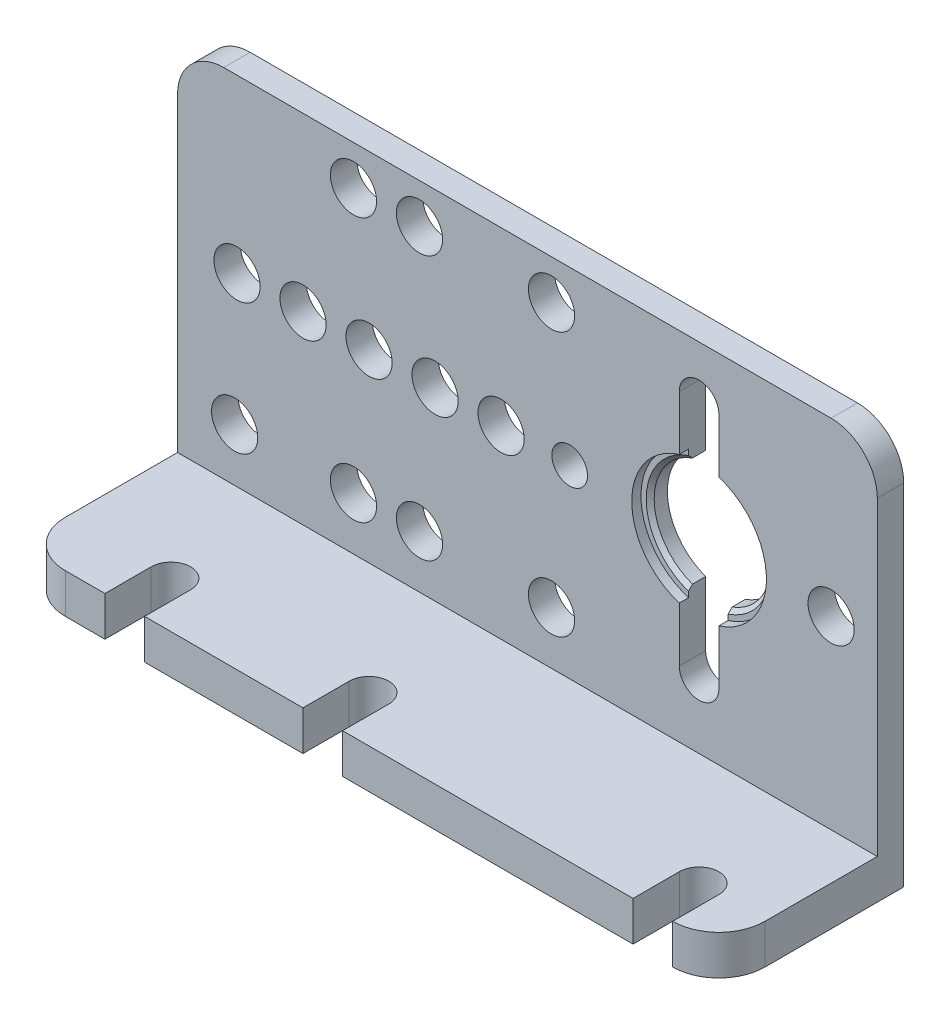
ISO-10303-21;
HEADER;
FILE_DESCRIPTION(('STEP AP214'),'2;1');
FILE_NAME('part.step','',(''),(''),'','','');
FILE_SCHEMA(('AUTOMOTIVE_DESIGN { 1 0 10303 214 1 1 1 1 }'));
ENDSEC;
DATA;
#1=APPLICATION_CONTEXT('core data for automotive mechanical design processes');
#2=APPLICATION_PROTOCOL_DEFINITION('international standard','automotive_design',2000,#1);
#3=PRODUCT_CONTEXT('',#1,'mechanical');
#4=PRODUCT('Part','Part','',(#3));
#5=PRODUCT_RELATED_PRODUCT_CATEGORY('part','',(#4));
#6=PRODUCT_DEFINITION_FORMATION('','',#4);
#7=PRODUCT_DEFINITION_CONTEXT('part definition',#1,'design');
#8=PRODUCT_DEFINITION('design','',#6,#7);
#9=PRODUCT_DEFINITION_SHAPE('','',#8);
#10=(LENGTH_UNIT() NAMED_UNIT(*) SI_UNIT(.MILLI.,.METRE.));
#11=(NAMED_UNIT(*) PLANE_ANGLE_UNIT() SI_UNIT($,.RADIAN.));
#12=(NAMED_UNIT(*) SI_UNIT($,.STERADIAN.) SOLID_ANGLE_UNIT());
#13=UNCERTAINTY_MEASURE_WITH_UNIT(LENGTH_MEASURE(1.E-05),#10,'distance_accuracy_value','');
#14=(GEOMETRIC_REPRESENTATION_CONTEXT(3) GLOBAL_UNCERTAINTY_ASSIGNED_CONTEXT((#13)) GLOBAL_UNIT_ASSIGNED_CONTEXT((#10,
#11,#12)) REPRESENTATION_CONTEXT('',''));
#15=CARTESIAN_POINT('',(0.,0.,0.));
#16=DIRECTION('',(0.,0.,1.));
#17=DIRECTION('',(1.,0.,0.));
#18=AXIS2_PLACEMENT_3D('',#15,#16,#17);
#19=CARTESIAN_POINT('',(13.,17.,0.));
#20=DIRECTION('',(0.,0.,1.));
#21=DIRECTION('',(1.,0.,0.));
#22=AXIS2_PLACEMENT_3D('',#19,#20,#21);
#23=CYLINDRICAL_SURFACE('',#22,4.4);
#24=DIRECTION('',(0.,0.,1.));
#25=VECTOR('',#24,1.);
#26=CARTESIAN_POINT('',(14.5,12.8635764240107,0.));
#27=LINE('',#26,#25);
#28=CARTESIAN_POINT('',(14.5,12.8635764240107,0.));
#29=VERTEX_POINT('',#28);
#30=CARTESIAN_POINT('',(14.5,12.8635764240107,1.));
#31=VERTEX_POINT('',#30);
#32=EDGE_CURVE('E307',#29,#31,#27,.T.);
#33=ORIENTED_EDGE('',*,*,#32,.T.);
#34=CARTESIAN_POINT('',(13.,17.,1.));
#35=DIRECTION('',(0.,0.,1.));
#36=DIRECTION('',(1.,0.,0.));
#37=AXIS2_PLACEMENT_3D('',#34,#35,#36);
#38=CIRCLE('',#37,4.4);
#39=CARTESIAN_POINT('',(14.5,21.1364235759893,1.));
#40=VERTEX_POINT('',#39);
#41=EDGE_CURVE('E576',#31,#40,#38,.T.);
#42=ORIENTED_EDGE('',*,*,#41,.T.);
#43=DIRECTION('',(0.,0.,1.));
#44=VECTOR('',#43,1.);
#45=CARTESIAN_POINT('',(14.5,21.1364235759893,0.));
#46=LINE('',#45,#44);
#47=CARTESIAN_POINT('',(14.5,21.1364235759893,0.));
#48=VERTEX_POINT('',#47);
#49=EDGE_CURVE('E305',#48,#40,#46,.T.);
#50=ORIENTED_EDGE('',*,*,#49,.F.);
#51=CARTESIAN_POINT('',(13.,17.,0.));
#52=DIRECTION('',(0.,0.,1.));
#53=DIRECTION('',(1.,0.,0.));
#54=AXIS2_PLACEMENT_3D('',#51,#52,#53);
#55=CIRCLE('',#54,4.4);
#56=EDGE_CURVE('E640',#29,#48,#55,.T.);
#57=ORIENTED_EDGE('',*,*,#56,.F.);
#58=EDGE_LOOP('',(#33,#42,#50,#57));
#59=FACE_BOUND('',#58,.T.);
#60=ADVANCED_FACE('F34',(#59),#23,.F.);
#61=CARTESIAN_POINT('',(13.,17.,0.));
#62=DIRECTION('',(0.,0.,1.));
#63=DIRECTION('',(1.,0.,0.));
#64=AXIS2_PLACEMENT_3D('',#61,#62,#63);
#65=CYLINDRICAL_SURFACE('',#64,4.4);
#66=DIRECTION('',(0.,0.,1.));
#67=VECTOR('',#66,1.);
#68=CARTESIAN_POINT('',(11.5,21.1364235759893,0.));
#69=LINE('',#68,#67);
#70=CARTESIAN_POINT('',(11.5,21.1364235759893,0.));
#71=VERTEX_POINT('',#70);
#72=CARTESIAN_POINT('',(11.5,21.1364235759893,0.999999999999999));
#73=VERTEX_POINT('',#72);
#74=EDGE_CURVE('E317',#71,#73,#69,.T.);
#75=ORIENTED_EDGE('',*,*,#74,.T.);
#76=CARTESIAN_POINT('',(13.,17.,0.999999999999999));
#77=DIRECTION('',(0.,0.,1.));
#78=DIRECTION('',(1.,0.,0.));
#79=AXIS2_PLACEMENT_3D('',#76,#77,#78);
#80=CIRCLE('',#79,4.4);
#81=CARTESIAN_POINT('',(11.5,12.8635764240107,0.999999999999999));
#82=VERTEX_POINT('',#81);
#83=EDGE_CURVE('E47',#73,#82,#80,.T.);
#84=ORIENTED_EDGE('',*,*,#83,.T.);
#85=DIRECTION('',(0.,0.,1.));
#86=VECTOR('',#85,1.);
#87=CARTESIAN_POINT('',(11.5,12.8635764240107,0.));
#88=LINE('',#87,#86);
#89=CARTESIAN_POINT('',(11.5,12.8635764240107,0.));
#90=VERTEX_POINT('',#89);
#91=EDGE_CURVE('E315',#90,#82,#88,.T.);
#92=ORIENTED_EDGE('',*,*,#91,.F.);
#93=CARTESIAN_POINT('',(13.,17.,0.));
#94=DIRECTION('',(0.,0.,1.));
#95=DIRECTION('',(1.,0.,0.));
#96=AXIS2_PLACEMENT_3D('',#93,#94,#95);
#97=CIRCLE('',#96,4.4);
#98=EDGE_CURVE('E660',#71,#90,#97,.T.);
#99=ORIENTED_EDGE('',*,*,#98,.F.);
#100=EDGE_LOOP('',(#75,#84,#92,#99));
#101=FACE_BOUND('',#100,.T.);
#102=ADVANCED_FACE('F597',(#101),#65,.F.);
#103=CARTESIAN_POINT('',(26.5,0.,14.));
#104=DIRECTION('',(0.,0.,-1.));
#105=DIRECTION('',(-1.,0.,0.));
#106=AXIS2_PLACEMENT_3D('',#103,#104,#105);
#107=PLANE('',#106);
#108=DIRECTION('',(-1.,0.,0.));
#109=VECTOR('',#108,1.);
#110=CARTESIAN_POINT('',(26.5,0.,14.));
#111=LINE('',#110,#109);
#112=CARTESIAN_POINT('',(-5.,0.,14.));
#113=VERTEX_POINT('',#112);
#114=CARTESIAN_POINT('',(-17.,0.,14.));
#115=VERTEX_POINT('',#114);
#116=EDGE_CURVE('E511',#113,#115,#111,.T.);
#117=ORIENTED_EDGE('',*,*,#116,.F.);
#118=DIRECTION('',(0.,1.,0.));
#119=VECTOR('',#118,1.);
#120=CARTESIAN_POINT('',(-5.,0.,14.));
#121=LINE('',#120,#119);
#122=CARTESIAN_POINT('',(-5.,3.,14.));
#123=VERTEX_POINT('',#122);
#124=EDGE_CURVE('E441',#113,#123,#121,.T.);
#125=ORIENTED_EDGE('',*,*,#124,.T.);
#126=DIRECTION('',(-1.,0.,0.));
#127=VECTOR('',#126,1.);
#128=CARTESIAN_POINT('',(26.5,3.,14.));
#129=LINE('',#128,#127);
#130=CARTESIAN_POINT('',(-17.,3.,14.));
#131=VERTEX_POINT('',#130);
#132=EDGE_CURVE('E515',#123,#131,#129,.T.);
#133=ORIENTED_EDGE('',*,*,#132,.T.);
#134=DIRECTION('',(0.,1.,0.));
#135=VECTOR('',#134,1.);
#136=CARTESIAN_POINT('',(-17.,0.,14.));
#137=LINE('',#136,#135);
#138=EDGE_CURVE('E480',#115,#131,#137,.T.);
#139=ORIENTED_EDGE('',*,*,#138,.F.);
#140=EDGE_LOOP('',(#117,#125,#133,#139));
#141=FACE_BOUND('',#140,.T.);
#142=ADVANCED_FACE('F600',(#141),#107,.F.);
#143=CARTESIAN_POINT('',(-20.,0.,14.));
#144=VERTEX_POINT('',#143);
#145=CARTESIAN_POINT('',(-23.,0.,14.));
#146=VERTEX_POINT('',#145);
#147=EDGE_CURVE('E507',#144,#146,#111,.T.);
#148=ORIENTED_EDGE('',*,*,#147,.F.);
#149=DIRECTION('',(0.,1.,0.));
#150=VECTOR('',#149,1.);
#151=CARTESIAN_POINT('',(-20.,0.,14.));
#152=LINE('',#151,#150);
#153=CARTESIAN_POINT('',(-20.,3.,14.));
#154=VERTEX_POINT('',#153);
#155=EDGE_CURVE('E468',#144,#154,#152,.T.);
#156=ORIENTED_EDGE('',*,*,#155,.T.);
#157=CARTESIAN_POINT('',(-23.,3.,14.));
#158=VERTEX_POINT('',#157);
#159=EDGE_CURVE('E510',#154,#158,#129,.T.);
#160=ORIENTED_EDGE('',*,*,#159,.T.);
#161=DIRECTION('',(0.,-1.,0.));
#162=VECTOR('',#161,1.);
#163=CARTESIAN_POINT('',(-23.,0.,14.));
#164=LINE('',#163,#162);
#165=EDGE_CURVE('E526',#158,#146,#164,.T.);
#166=ORIENTED_EDGE('',*,*,#165,.T.);
#167=EDGE_LOOP('',(#148,#156,#160,#166));
#168=FACE_BOUND('',#167,.T.);
#169=ADVANCED_FACE('F812',(#168),#107,.F.);
#170=CARTESIAN_POINT('',(26.5,30.,0.));
#171=DIRECTION('',(0.,0.,1.));
#172=DIRECTION('',(0.,-1.,0.));
#173=AXIS2_PLACEMENT_3D('',#170,#171,#172);
#174=PLANE('',#173);
#175=DIRECTION('',(0.,1.,0.));
#176=VECTOR('',#175,1.);
#177=CARTESIAN_POINT('',(14.5,26.,0.));
#178=LINE('',#177,#176);
#179=CARTESIAN_POINT('',(14.5,26.,0.));
#180=VERTEX_POINT('',#179);
#181=EDGE_CURVE('E322',#48,#180,#178,.T.);
#182=ORIENTED_EDGE('',*,*,#181,.T.);
#183=CARTESIAN_POINT('',(13.,26.,0.));
#184=DIRECTION('',(0.,0.,1.));
#185=DIRECTION('',(1.,0.,0.));
#186=AXIS2_PLACEMENT_3D('',#183,#184,#185);
#187=CIRCLE('',#186,1.5);
#188=CARTESIAN_POINT('',(11.5,26.,0.));
#189=VERTEX_POINT('',#188);
#190=EDGE_CURVE('E292',#180,#189,#187,.T.);
#191=ORIENTED_EDGE('',*,*,#190,.T.);
#192=DIRECTION('',(0.,-1.,0.));
#193=VECTOR('',#192,1.);
#194=CARTESIAN_POINT('',(11.5,26.,0.));
#195=LINE('',#194,#193);
#196=EDGE_CURVE('E296',#189,#71,#195,.T.);
#197=ORIENTED_EDGE('',*,*,#196,.T.);
#198=ORIENTED_EDGE('',*,*,#98,.T.);
#199=DIRECTION('',(0.,-1.,0.));
#200=VECTOR('',#199,1.);
#201=CARTESIAN_POINT('',(11.5,12.8635764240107,0.));
#202=LINE('',#201,#200);
#203=CARTESIAN_POINT('',(11.5,8.,0.));
#204=VERTEX_POINT('',#203);
#205=EDGE_CURVE('E663',#90,#204,#202,.T.);
#206=ORIENTED_EDGE('',*,*,#205,.T.);
#207=CARTESIAN_POINT('',(13.,8.,0.));
#208=DIRECTION('',(0.,0.,1.));
#209=DIRECTION('',(1.,0.,0.));
#210=AXIS2_PLACEMENT_3D('',#207,#208,#209);
#211=CIRCLE('',#210,1.5);
#212=CARTESIAN_POINT('',(14.5,8.,0.));
#213=VERTEX_POINT('',#212);
#214=EDGE_CURVE('E666',#204,#213,#211,.T.);
#215=ORIENTED_EDGE('',*,*,#214,.T.);
#216=DIRECTION('',(0.,1.,0.));
#217=VECTOR('',#216,1.);
#218=CARTESIAN_POINT('',(14.5,12.8635764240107,0.));
#219=LINE('',#218,#217);
#220=EDGE_CURVE('E669',#213,#29,#219,.T.);
#221=ORIENTED_EDGE('',*,*,#220,.T.);
#222=ORIENTED_EDGE('',*,*,#56,.T.);
#223=EDGE_LOOP('',(#182,#191,#197,#198,#206,#215,#221,#222));
#224=FACE_BOUND('',#223,.T.);
#225=CARTESIAN_POINT('',(3.2,17.,0.));
#226=DIRECTION('',(0.,0.,1.));
#227=DIRECTION('',(1.,0.,0.));
#228=AXIS2_PLACEMENT_3D('',#225,#226,#227);
#229=CIRCLE('',#228,1.35000000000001);
#230=CARTESIAN_POINT('',(4.55,17.,0.));
#231=VERTEX_POINT('',#230);
#232=EDGE_CURVE('E323',#231,#231,#229,.T.);
#233=ORIENTED_EDGE('',*,*,#232,.T.);
#234=EDGE_LOOP('',(#233));
#235=FACE_BOUND('',#234,.T.);
#236=CARTESIAN_POINT('',(-22.1746021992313,7.,0.));
#237=DIRECTION('',(0.,0.,1.));
#238=DIRECTION('',(1.,0.,0.));
#239=AXIS2_PLACEMENT_3D('',#236,#237,#238);
#240=CIRCLE('',#239,1.74999999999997);
#241=CARTESIAN_POINT('',(-20.4246021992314,7.,0.));
#242=VERTEX_POINT('',#241);
#243=EDGE_CURVE('E329',#242,#242,#240,.T.);
#244=ORIENTED_EDGE('',*,*,#243,.T.);
#245=EDGE_LOOP('',(#244));
#246=FACE_BOUND('',#245,.T.);
#247=CARTESIAN_POINT('',(-13.1746021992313,7.,0.));
#248=DIRECTION('',(0.,0.,1.));
#249=DIRECTION('',(1.,0.,0.));
#250=AXIS2_PLACEMENT_3D('',#247,#248,#249);
#251=CIRCLE('',#250,1.75);
#252=CARTESIAN_POINT('',(-11.4246021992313,7.,0.));
#253=VERTEX_POINT('',#252);
#254=EDGE_CURVE('E335',#253,#253,#251,.T.);
#255=ORIENTED_EDGE('',*,*,#254,.T.);
#256=EDGE_LOOP('',(#255));
#257=FACE_BOUND('',#256,.T.);
#258=CARTESIAN_POINT('',(-13.1746021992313,27.,0.));
#259=DIRECTION('',(0.,0.,1.));
#260=DIRECTION('',(1.,0.,0.));
#261=AXIS2_PLACEMENT_3D('',#258,#259,#260);
#262=CIRCLE('',#261,1.75);
#263=CARTESIAN_POINT('',(-11.4246021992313,27.,0.));
#264=VERTEX_POINT('',#263);
#265=EDGE_CURVE('E341',#264,#264,#262,.T.);
#266=ORIENTED_EDGE('',*,*,#265,.T.);
#267=EDGE_LOOP('',(#266));
#268=FACE_BOUND('',#267,.T.);
#269=CARTESIAN_POINT('',(-21.9957238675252,16.9999999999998,0.));
#270=DIRECTION('',(0.,0.,1.));
#271=DIRECTION('',(1.,0.,0.));
#272=AXIS2_PLACEMENT_3D('',#269,#270,#271);
#273=CIRCLE('',#272,1.75);
#274=CARTESIAN_POINT('',(-20.2457238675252,16.9999999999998,0.));
#275=VERTEX_POINT('',#274);
#276=EDGE_CURVE('E347',#275,#275,#273,.T.);
#277=ORIENTED_EDGE('',*,*,#276,.T.);
#278=EDGE_LOOP('',(#277));
#279=FACE_BOUND('',#278,.T.);
#280=CARTESIAN_POINT('',(-16.9957238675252,16.9999999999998,0.));
#281=DIRECTION('',(0.,0.,1.));
#282=DIRECTION('',(1.,0.,0.));
#283=AXIS2_PLACEMENT_3D('',#280,#281,#282);
#284=CIRCLE('',#283,1.75);
#285=CARTESIAN_POINT('',(-15.2457238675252,16.9999999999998,0.));
#286=VERTEX_POINT('',#285);
#287=EDGE_CURVE('E353',#286,#286,#284,.T.);
#288=ORIENTED_EDGE('',*,*,#287,.T.);
#289=EDGE_LOOP('',(#288));
#290=FACE_BOUND('',#289,.T.);
#291=CARTESIAN_POINT('',(-11.9957238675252,16.9999999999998,0.));
#292=DIRECTION('',(0.,0.,1.));
#293=DIRECTION('',(1.,0.,0.));
#294=AXIS2_PLACEMENT_3D('',#291,#292,#293);
#295=CIRCLE('',#294,1.75);
#296=CARTESIAN_POINT('',(-10.2457238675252,16.9999999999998,0.));
#297=VERTEX_POINT('',#296);
#298=EDGE_CURVE('E359',#297,#297,#295,.T.);
#299=ORIENTED_EDGE('',*,*,#298,.T.);
#300=EDGE_LOOP('',(#299));
#301=FACE_BOUND('',#300,.T.);
#302=CARTESIAN_POINT('',(23.,17.,0.));
#303=DIRECTION('',(0.,0.,1.));
#304=DIRECTION('',(1.,0.,0.));
#305=AXIS2_PLACEMENT_3D('',#302,#303,#304);
#306=CIRCLE('',#305,1.75);
#307=CARTESIAN_POINT('',(24.75,17.,0.));
#308=VERTEX_POINT('',#307);
#309=EDGE_CURVE('E365',#308,#308,#306,.T.);
#310=ORIENTED_EDGE('',*,*,#309,.T.);
#311=EDGE_LOOP('',(#310));
#312=FACE_BOUND('',#311,.T.);
#313=CARTESIAN_POINT('',(-6.99572386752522,17.,0.));
#314=DIRECTION('',(0.,0.,1.));
#315=DIRECTION('',(1.,0.,0.));
#316=AXIS2_PLACEMENT_3D('',#313,#314,#315);
#317=CIRCLE('',#316,1.74999999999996);
#318=CARTESIAN_POINT('',(-5.24572386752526,17.,0.));
#319=VERTEX_POINT('',#318);
#320=EDGE_CURVE('E371',#319,#319,#317,.T.);
#321=ORIENTED_EDGE('',*,*,#320,.T.);
#322=EDGE_LOOP('',(#321));
#323=FACE_BOUND('',#322,.T.);
#324=CARTESIAN_POINT('',(-8.17460219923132,6.99999999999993,0.));
#325=DIRECTION('',(0.,0.,1.));
#326=DIRECTION('',(1.,0.,0.));
#327=AXIS2_PLACEMENT_3D('',#324,#325,#326);
#328=CIRCLE('',#327,1.75);
#329=CARTESIAN_POINT('',(-6.42460219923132,6.99999999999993,0.));
#330=VERTEX_POINT('',#329);
#331=EDGE_CURVE('E377',#330,#330,#328,.T.);
#332=ORIENTED_EDGE('',*,*,#331,.T.);
#333=EDGE_LOOP('',(#332));
#334=FACE_BOUND('',#333,.T.);
#335=CARTESIAN_POINT('',(-8.17460219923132,27.,0.));
#336=DIRECTION('',(0.,0.,1.));
#337=DIRECTION('',(1.,0.,0.));
#338=AXIS2_PLACEMENT_3D('',#335,#336,#337);
#339=CIRCLE('',#338,1.74999999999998);
#340=CARTESIAN_POINT('',(-6.42460219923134,27.,0.));
#341=VERTEX_POINT('',#340);
#342=EDGE_CURVE('E383',#341,#341,#339,.T.);
#343=ORIENTED_EDGE('',*,*,#342,.T.);
#344=EDGE_LOOP('',(#343));
#345=FACE_BOUND('',#344,.T.);
#346=CARTESIAN_POINT('',(1.82539780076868,7.,0.));
#347=DIRECTION('',(0.,0.,1.));
#348=DIRECTION('',(1.,0.,0.));
#349=AXIS2_PLACEMENT_3D('',#346,#347,#348);
#350=CIRCLE('',#349,1.75);
#351=CARTESIAN_POINT('',(3.57539780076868,7.,0.));
#352=VERTEX_POINT('',#351);
#353=EDGE_CURVE('E389',#352,#352,#350,.T.);
#354=ORIENTED_EDGE('',*,*,#353,.T.);
#355=EDGE_LOOP('',(#354));
#356=FACE_BOUND('',#355,.T.);
#357=CARTESIAN_POINT('',(-1.99572386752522,16.9999999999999,0.));
#358=DIRECTION('',(0.,0.,1.));
#359=DIRECTION('',(1.,0.,0.));
#360=AXIS2_PLACEMENT_3D('',#357,#358,#359);
#361=CIRCLE('',#360,1.75);
#362=CARTESIAN_POINT('',(-0.245723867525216,16.9999999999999,0.));
#363=VERTEX_POINT('',#362);
#364=EDGE_CURVE('E395',#363,#363,#361,.T.);
#365=ORIENTED_EDGE('',*,*,#364,.T.);
#366=EDGE_LOOP('',(#365));
#367=FACE_BOUND('',#366,.T.);
#368=CARTESIAN_POINT('',(1.82539780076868,27.,0.));
#369=DIRECTION('',(0.,0.,1.));
#370=DIRECTION('',(1.,0.,0.));
#371=AXIS2_PLACEMENT_3D('',#368,#369,#370);
#372=CIRCLE('',#371,1.75);
#373=CARTESIAN_POINT('',(3.57539780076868,27.,0.));
#374=VERTEX_POINT('',#373);
#375=EDGE_CURVE('E401',#374,#374,#372,.T.);
#376=ORIENTED_EDGE('',*,*,#375,.T.);
#377=EDGE_LOOP('',(#376));
#378=FACE_BOUND('',#377,.T.);
#379=DIRECTION('',(-1.,0.,0.));
#380=VECTOR('',#379,1.);
#381=CARTESIAN_POINT('',(26.5,30.,0.));
#382=LINE('',#381,#380);
#383=CARTESIAN_POINT('',(23.,30.,0.));
#384=VERTEX_POINT('',#383);
#385=CARTESIAN_POINT('',(-23.,30.,0.));
#386=VERTEX_POINT('',#385);
#387=EDGE_CURVE('E521',#384,#386,#382,.T.);
#388=ORIENTED_EDGE('',*,*,#387,.F.);
#389=CARTESIAN_POINT('',(23.,26.5,0.));
#390=DIRECTION('',(0.,0.,1.));
#391=DIRECTION('',(0.,-1.,0.));
#392=AXIS2_PLACEMENT_3D('',#389,#390,#391);
#393=CIRCLE('',#392,3.5);
#394=CARTESIAN_POINT('',(26.5,26.5,0.));
#395=VERTEX_POINT('',#394);
#396=EDGE_CURVE('E560',#384,#395,#393,.F.);
#397=ORIENTED_EDGE('',*,*,#396,.T.);
#398=DIRECTION('',(0.,1.,0.));
#399=VECTOR('',#398,1.);
#400=CARTESIAN_POINT('',(26.5,30.,0.));
#401=LINE('',#400,#399);
#402=CARTESIAN_POINT('',(26.5,0.,0.));
#403=VERTEX_POINT('',#402);
#404=EDGE_CURVE('E485',#403,#395,#401,.T.);
#405=ORIENTED_EDGE('',*,*,#404,.F.);
#406=DIRECTION('',(-1.,0.,0.));
#407=VECTOR('',#406,1.);
#408=CARTESIAN_POINT('',(26.5,0.,0.));
#409=LINE('',#408,#407);
#410=CARTESIAN_POINT('',(-26.5,0.,0.));
#411=VERTEX_POINT('',#410);
#412=EDGE_CURVE('E496',#403,#411,#409,.T.);
#413=ORIENTED_EDGE('',*,*,#412,.T.);
#414=DIRECTION('',(0.,1.,0.));
#415=VECTOR('',#414,1.);
#416=CARTESIAN_POINT('',(-26.5,30.,0.));
#417=LINE('',#416,#415);
#418=CARTESIAN_POINT('',(-26.5,26.5,0.));
#419=VERTEX_POINT('',#418);
#420=EDGE_CURVE('E477',#411,#419,#417,.T.);
#421=ORIENTED_EDGE('',*,*,#420,.T.);
#422=CARTESIAN_POINT('',(-23.,26.5,0.));
#423=DIRECTION('',(0.,0.,1.));
#424=DIRECTION('',(0.,-1.,0.));
#425=AXIS2_PLACEMENT_3D('',#422,#423,#424);
#426=CIRCLE('',#425,3.5);
#427=EDGE_CURVE('E558',#419,#386,#426,.F.);
#428=ORIENTED_EDGE('',*,*,#427,.T.);
#429=EDGE_LOOP('',(#388,#397,#405,#413,#421,#428));
#430=FACE_BOUND('',#429,.T.);
#431=ADVANCED_FACE('F684',(#224,#235,#246,#257,#268,#279,#290,#301,#312,#323,#334,#345,#356,
#367,#378,#430),#174,.F.);
#432=CARTESIAN_POINT('',(26.5,30.,2.));
#433=DIRECTION('',(0.,-1.,0.));
#434=DIRECTION('',(0.,0.,-1.));
#435=AXIS2_PLACEMENT_3D('',#432,#433,#434);
#436=PLANE('',#435);
#437=DIRECTION('',(-1.,0.,0.));
#438=VECTOR('',#437,1.);
#439=CARTESIAN_POINT('',(26.5,30.,2.));
#440=LINE('',#439,#438);
#441=CARTESIAN_POINT('',(23.,30.,2.));
#442=VERTEX_POINT('',#441);
#443=CARTESIAN_POINT('',(-23.,30.,2.));
#444=VERTEX_POINT('',#443);
#445=EDGE_CURVE('E518',#442,#444,#440,.T.);
#446=ORIENTED_EDGE('',*,*,#445,.F.);
#447=DIRECTION('',(0.,0.,1.));
#448=VECTOR('',#447,1.);
#449=CARTESIAN_POINT('',(23.,30.,0.));
#450=LINE('',#449,#448);
#451=EDGE_CURVE('E556',#442,#384,#450,.F.);
#452=ORIENTED_EDGE('',*,*,#451,.T.);
#453=ORIENTED_EDGE('',*,*,#387,.T.);
#454=DIRECTION('',(0.,0.,1.));
#455=VECTOR('',#454,1.);
#456=CARTESIAN_POINT('',(-23.,30.,2.));
#457=LINE('',#456,#455);
#458=EDGE_CURVE('E553',#386,#444,#457,.T.);
#459=ORIENTED_EDGE('',*,*,#458,.T.);
#460=EDGE_LOOP('',(#446,#452,#453,#459));
#461=FACE_BOUND('',#460,.T.);
#462=ADVANCED_FACE('F818',(#461),#436,.F.);
#463=CARTESIAN_POINT('',(26.5,3.,2.));
#464=DIRECTION('',(0.,0.,-1.));
#465=DIRECTION('',(-1.,0.,0.));
#466=AXIS2_PLACEMENT_3D('',#463,#464,#465);
#467=PLANE('',#466);
#468=DIRECTION('',(0.,1.,0.));
#469=VECTOR('',#468,1.);
#470=CARTESIAN_POINT('',(14.5,26.,2.));
#471=LINE('',#470,#469);
#472=CARTESIAN_POINT('',(14.5,21.8744230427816,2.));
#473=VERTEX_POINT('',#472);
#474=CARTESIAN_POINT('',(14.5,26.,2.));
#475=VERTEX_POINT('',#474);
#476=EDGE_CURVE('E282',#473,#475,#471,.T.);
#477=ORIENTED_EDGE('',*,*,#476,.F.);
#478=CARTESIAN_POINT('',(13.,17.,2.));
#479=DIRECTION('',(0.,0.,1.));
#480=DIRECTION('',(1.,0.,0.));
#481=AXIS2_PLACEMENT_3D('',#478,#479,#480);
#482=CIRCLE('',#481,5.1);
#483=CARTESIAN_POINT('',(14.5,12.1255769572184,2.));
#484=VERTEX_POINT('',#483);
#485=EDGE_CURVE('E264',#484,#473,#482,.T.);
#486=ORIENTED_EDGE('',*,*,#485,.F.);
#487=DIRECTION('',(0.,1.,0.));
#488=VECTOR('',#487,1.);
#489=CARTESIAN_POINT('',(14.5,12.8635764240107,2.));
#490=LINE('',#489,#488);
#491=CARTESIAN_POINT('',(14.5,8.,2.));
#492=VERTEX_POINT('',#491);
#493=EDGE_CURVE('E293',#492,#484,#490,.T.);
#494=ORIENTED_EDGE('',*,*,#493,.F.);
#495=CARTESIAN_POINT('',(13.,8.,2.));
#496=DIRECTION('',(0.,0.,1.));
#497=DIRECTION('',(1.,0.,0.));
#498=AXIS2_PLACEMENT_3D('',#495,#496,#497);
#499=CIRCLE('',#498,1.5);
#500=CARTESIAN_POINT('',(11.5,8.,2.));
#501=VERTEX_POINT('',#500);
#502=EDGE_CURVE('E298',#501,#492,#499,.T.);
#503=ORIENTED_EDGE('',*,*,#502,.F.);
#504=DIRECTION('',(0.,-1.,0.));
#505=VECTOR('',#504,1.);
#506=CARTESIAN_POINT('',(11.5,12.8635764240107,2.));
#507=LINE('',#506,#505);
#508=CARTESIAN_POINT('',(11.5,12.1255769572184,2.));
#509=VERTEX_POINT('',#508);
#510=EDGE_CURVE('E678',#509,#501,#507,.T.);
#511=ORIENTED_EDGE('',*,*,#510,.F.);
#512=CARTESIAN_POINT('',(11.5,21.8744230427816,2.));
#513=VERTEX_POINT('',#512);
#514=EDGE_CURVE('E276',#513,#509,#482,.T.);
#515=ORIENTED_EDGE('',*,*,#514,.F.);
#516=DIRECTION('',(0.,-1.,0.));
#517=VECTOR('',#516,1.);
#518=CARTESIAN_POINT('',(11.5,26.,2.));
#519=LINE('',#518,#517);
#520=CARTESIAN_POINT('',(11.5,26.,2.));
#521=VERTEX_POINT('',#520);
#522=EDGE_CURVE('E675',#521,#513,#519,.T.);
#523=ORIENTED_EDGE('',*,*,#522,.F.);
#524=CARTESIAN_POINT('',(13.,26.,2.));
#525=DIRECTION('',(0.,0.,1.));
#526=DIRECTION('',(1.,0.,0.));
#527=AXIS2_PLACEMENT_3D('',#524,#525,#526);
#528=CIRCLE('',#527,1.5);
#529=EDGE_CURVE('E286',#475,#521,#528,.T.);
#530=ORIENTED_EDGE('',*,*,#529,.F.);
#531=EDGE_LOOP('',(#477,#486,#494,#503,#511,#515,#523,#530));
#532=FACE_BOUND('',#531,.T.);
#533=CARTESIAN_POINT('',(3.2,17.,2.));
#534=DIRECTION('',(0.,0.,1.));
#535=DIRECTION('',(1.,0.,0.));
#536=AXIS2_PLACEMENT_3D('',#533,#534,#535);
#537=CIRCLE('',#536,1.35000000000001);
#538=CARTESIAN_POINT('',(4.55,17.,2.));
#539=VERTEX_POINT('',#538);
#540=EDGE_CURVE('E304',#539,#539,#537,.T.);
#541=ORIENTED_EDGE('',*,*,#540,.F.);
#542=EDGE_LOOP('',(#541));
#543=FACE_BOUND('',#542,.T.);
#544=CARTESIAN_POINT('',(-22.1746021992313,7.,2.));
#545=DIRECTION('',(0.,0.,1.));
#546=DIRECTION('',(1.,0.,0.));
#547=AXIS2_PLACEMENT_3D('',#544,#545,#546);
#548=CIRCLE('',#547,1.74999999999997);
#549=CARTESIAN_POINT('',(-20.4246021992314,7.,2.));
#550=VERTEX_POINT('',#549);
#551=EDGE_CURVE('E326',#550,#550,#548,.T.);
#552=ORIENTED_EDGE('',*,*,#551,.F.);
#553=EDGE_LOOP('',(#552));
#554=FACE_BOUND('',#553,.T.);
#555=CARTESIAN_POINT('',(-13.1746021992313,7.,2.));
#556=DIRECTION('',(0.,0.,1.));
#557=DIRECTION('',(1.,0.,0.));
#558=AXIS2_PLACEMENT_3D('',#555,#556,#557);
#559=CIRCLE('',#558,1.75);
#560=CARTESIAN_POINT('',(-11.4246021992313,7.,2.));
#561=VERTEX_POINT('',#560);
#562=EDGE_CURVE('E332',#561,#561,#559,.T.);
#563=ORIENTED_EDGE('',*,*,#562,.F.);
#564=EDGE_LOOP('',(#563));
#565=FACE_BOUND('',#564,.T.);
#566=CARTESIAN_POINT('',(-13.1746021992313,27.,2.));
#567=DIRECTION('',(0.,0.,1.));
#568=DIRECTION('',(1.,0.,0.));
#569=AXIS2_PLACEMENT_3D('',#566,#567,#568);
#570=CIRCLE('',#569,1.75);
#571=CARTESIAN_POINT('',(-11.4246021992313,27.,2.));
#572=VERTEX_POINT('',#571);
#573=EDGE_CURVE('E338',#572,#572,#570,.T.);
#574=ORIENTED_EDGE('',*,*,#573,.F.);
#575=EDGE_LOOP('',(#574));
#576=FACE_BOUND('',#575,.T.);
#577=CARTESIAN_POINT('',(-21.9957238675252,16.9999999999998,2.));
#578=DIRECTION('',(0.,0.,1.));
#579=DIRECTION('',(1.,0.,0.));
#580=AXIS2_PLACEMENT_3D('',#577,#578,#579);
#581=CIRCLE('',#580,1.75);
#582=CARTESIAN_POINT('',(-20.2457238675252,16.9999999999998,2.));
#583=VERTEX_POINT('',#582);
#584=EDGE_CURVE('E344',#583,#583,#581,.T.);
#585=ORIENTED_EDGE('',*,*,#584,.F.);
#586=EDGE_LOOP('',(#585));
#587=FACE_BOUND('',#586,.T.);
#588=CARTESIAN_POINT('',(-16.9957238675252,16.9999999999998,2.));
#589=DIRECTION('',(0.,0.,1.));
#590=DIRECTION('',(1.,0.,0.));
#591=AXIS2_PLACEMENT_3D('',#588,#589,#590);
#592=CIRCLE('',#591,1.75);
#593=CARTESIAN_POINT('',(-15.2457238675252,16.9999999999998,2.));
#594=VERTEX_POINT('',#593);
#595=EDGE_CURVE('E350',#594,#594,#592,.T.);
#596=ORIENTED_EDGE('',*,*,#595,.F.);
#597=EDGE_LOOP('',(#596));
#598=FACE_BOUND('',#597,.T.);
#599=CARTESIAN_POINT('',(-11.9957238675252,16.9999999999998,2.));
#600=DIRECTION('',(0.,0.,1.));
#601=DIRECTION('',(1.,0.,0.));
#602=AXIS2_PLACEMENT_3D('',#599,#600,#601);
#603=CIRCLE('',#602,1.75);
#604=CARTESIAN_POINT('',(-10.2457238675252,16.9999999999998,2.));
#605=VERTEX_POINT('',#604);
#606=EDGE_CURVE('E356',#605,#605,#603,.T.);
#607=ORIENTED_EDGE('',*,*,#606,.F.);
#608=EDGE_LOOP('',(#607));
#609=FACE_BOUND('',#608,.T.);
#610=CARTESIAN_POINT('',(23.,17.,2.));
#611=DIRECTION('',(0.,0.,1.));
#612=DIRECTION('',(1.,0.,0.));
#613=AXIS2_PLACEMENT_3D('',#610,#611,#612);
#614=CIRCLE('',#613,1.75);
#615=CARTESIAN_POINT('',(24.75,17.,2.));
#616=VERTEX_POINT('',#615);
#617=EDGE_CURVE('E362',#616,#616,#614,.T.);
#618=ORIENTED_EDGE('',*,*,#617,.F.);
#619=EDGE_LOOP('',(#618));
#620=FACE_BOUND('',#619,.T.);
#621=CARTESIAN_POINT('',(-6.99572386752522,17.,2.));
#622=DIRECTION('',(0.,0.,1.));
#623=DIRECTION('',(1.,0.,0.));
#624=AXIS2_PLACEMENT_3D('',#621,#622,#623);
#625=CIRCLE('',#624,1.74999999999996);
#626=CARTESIAN_POINT('',(-5.24572386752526,17.,2.));
#627=VERTEX_POINT('',#626);
#628=EDGE_CURVE('E368',#627,#627,#625,.T.);
#629=ORIENTED_EDGE('',*,*,#628,.F.);
#630=EDGE_LOOP('',(#629));
#631=FACE_BOUND('',#630,.T.);
#632=CARTESIAN_POINT('',(-8.17460219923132,6.99999999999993,2.));
#633=DIRECTION('',(0.,0.,1.));
#634=DIRECTION('',(1.,0.,0.));
#635=AXIS2_PLACEMENT_3D('',#632,#633,#634);
#636=CIRCLE('',#635,1.75);
#637=CARTESIAN_POINT('',(-6.42460219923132,6.99999999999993,2.));
#638=VERTEX_POINT('',#637);
#639=EDGE_CURVE('E374',#638,#638,#636,.T.);
#640=ORIENTED_EDGE('',*,*,#639,.F.);
#641=EDGE_LOOP('',(#640));
#642=FACE_BOUND('',#641,.T.);
#643=CARTESIAN_POINT('',(-8.17460219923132,27.,2.));
#644=DIRECTION('',(0.,0.,1.));
#645=DIRECTION('',(1.,0.,0.));
#646=AXIS2_PLACEMENT_3D('',#643,#644,#645);
#647=CIRCLE('',#646,1.74999999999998);
#648=CARTESIAN_POINT('',(-6.42460219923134,27.,2.));
#649=VERTEX_POINT('',#648);
#650=EDGE_CURVE('E380',#649,#649,#647,.T.);
#651=ORIENTED_EDGE('',*,*,#650,.F.);
#652=EDGE_LOOP('',(#651));
#653=FACE_BOUND('',#652,.T.);
#654=CARTESIAN_POINT('',(1.82539780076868,7.,2.));
#655=DIRECTION('',(0.,0.,1.));
#656=DIRECTION('',(1.,0.,0.));
#657=AXIS2_PLACEMENT_3D('',#654,#655,#656);
#658=CIRCLE('',#657,1.75);
#659=CARTESIAN_POINT('',(3.57539780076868,7.,2.));
#660=VERTEX_POINT('',#659);
#661=EDGE_CURVE('E386',#660,#660,#658,.T.);
#662=ORIENTED_EDGE('',*,*,#661,.F.);
#663=EDGE_LOOP('',(#662));
#664=FACE_BOUND('',#663,.T.);
#665=CARTESIAN_POINT('',(-1.99572386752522,16.9999999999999,2.));
#666=DIRECTION('',(0.,0.,1.));
#667=DIRECTION('',(1.,0.,0.));
#668=AXIS2_PLACEMENT_3D('',#665,#666,#667);
#669=CIRCLE('',#668,1.75);
#670=CARTESIAN_POINT('',(-0.245723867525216,16.9999999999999,2.));
#671=VERTEX_POINT('',#670);
#672=EDGE_CURVE('E392',#671,#671,#669,.T.);
#673=ORIENTED_EDGE('',*,*,#672,.F.);
#674=EDGE_LOOP('',(#673));
#675=FACE_BOUND('',#674,.T.);
#676=CARTESIAN_POINT('',(1.82539780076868,27.,2.));
#677=DIRECTION('',(0.,0.,1.));
#678=DIRECTION('',(1.,0.,0.));
#679=AXIS2_PLACEMENT_3D('',#676,#677,#678);
#680=CIRCLE('',#679,1.75);
#681=CARTESIAN_POINT('',(3.57539780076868,27.,2.));
#682=VERTEX_POINT('',#681);
#683=EDGE_CURVE('E398',#682,#682,#680,.T.);
#684=ORIENTED_EDGE('',*,*,#683,.F.);
#685=EDGE_LOOP('',(#684));
#686=FACE_BOUND('',#685,.T.);
#687=DIRECTION('',(0.,-1.,0.));
#688=VECTOR('',#687,1.);
#689=CARTESIAN_POINT('',(26.5,3.,2.));
#690=LINE('',#689,#688);
#691=CARTESIAN_POINT('',(26.5,26.5,2.));
#692=VERTEX_POINT('',#691);
#693=CARTESIAN_POINT('',(26.5,3.,2.));
#694=VERTEX_POINT('',#693);
#695=EDGE_CURVE('E488',#692,#694,#690,.T.);
#696=ORIENTED_EDGE('',*,*,#695,.F.);
#697=CARTESIAN_POINT('',(23.,26.5,2.));
#698=DIRECTION('',(0.,0.,-1.));
#699=DIRECTION('',(-1.,0.,0.));
#700=AXIS2_PLACEMENT_3D('',#697,#698,#699);
#701=CIRCLE('',#700,3.5);
#702=EDGE_CURVE('E551',#692,#442,#701,.F.);
#703=ORIENTED_EDGE('',*,*,#702,.T.);
#704=ORIENTED_EDGE('',*,*,#445,.T.);
#705=CARTESIAN_POINT('',(-23.,26.5,2.));
#706=DIRECTION('',(0.,0.,-1.));
#707=DIRECTION('',(-1.,0.,0.));
#708=AXIS2_PLACEMENT_3D('',#705,#706,#707);
#709=CIRCLE('',#708,3.5);
#710=CARTESIAN_POINT('',(-26.5,26.5,2.));
#711=VERTEX_POINT('',#710);
#712=EDGE_CURVE('E549',#444,#711,#709,.F.);
#713=ORIENTED_EDGE('',*,*,#712,.T.);
#714=DIRECTION('',(0.,-1.,0.));
#715=VECTOR('',#714,1.);
#716=CARTESIAN_POINT('',(-26.5,3.,2.));
#717=LINE('',#716,#715);
#718=CARTESIAN_POINT('',(-26.5,3.,2.));
#719=VERTEX_POINT('',#718);
#720=EDGE_CURVE('E499',#711,#719,#717,.T.);
#721=ORIENTED_EDGE('',*,*,#720,.T.);
#722=DIRECTION('',(-1.,0.,0.));
#723=VECTOR('',#722,1.);
#724=CARTESIAN_POINT('',(26.5,3.,2.));
#725=LINE('',#724,#723);
#726=EDGE_CURVE('E514',#694,#719,#725,.T.);
#727=ORIENTED_EDGE('',*,*,#726,.F.);
#728=EDGE_LOOP('',(#696,#703,#704,#713,#721,#727));
#729=FACE_BOUND('',#728,.T.);
#730=ADVANCED_FACE('F289',(#532,#543,#554,#565,#576,#587,#598,#609,#620,#631,#642,#653,#664,
#675,#686,#729),#467,.F.);
#731=CARTESIAN_POINT('',(26.5,3.,14.));
#732=DIRECTION('',(0.,-1.,0.));
#733=DIRECTION('',(0.,0.,-1.));
#734=AXIS2_PLACEMENT_3D('',#731,#732,#733);
#735=PLANE('',#734);
#736=CARTESIAN_POINT('',(20.,3.,14.));
#737=VERTEX_POINT('',#736);
#738=CARTESIAN_POINT('',(-2.,3.,14.));
#739=VERTEX_POINT('',#738);
#740=EDGE_CURVE('E512',#737,#739,#129,.T.);
#741=ORIENTED_EDGE('',*,*,#740,.F.);
#742=DIRECTION('',(0.,0.,1.));
#743=VECTOR('',#742,1.);
#744=CARTESIAN_POINT('',(20.,3.,14.));
#745=LINE('',#744,#743);
#746=CARTESIAN_POINT('',(20.,3.,10.5));
#747=VERTEX_POINT('',#746);
#748=EDGE_CURVE('E404',#747,#737,#745,.T.);
#749=ORIENTED_EDGE('',*,*,#748,.F.);
#750=CARTESIAN_POINT('',(21.5,3.,10.5));
#751=DIRECTION('',(0.,1.,0.));
#752=DIRECTION('',(0.,0.,-1.));
#753=AXIS2_PLACEMENT_3D('',#750,#751,#752);
#754=CIRCLE('',#753,1.5);
#755=CARTESIAN_POINT('',(23.,3.,10.5));
#756=VERTEX_POINT('',#755);
#757=EDGE_CURVE('E411',#756,#747,#754,.T.);
#758=ORIENTED_EDGE('',*,*,#757,.F.);
#759=DIRECTION('',(0.,0.,-1.));
#760=VECTOR('',#759,1.);
#761=CARTESIAN_POINT('',(23.,3.,14.));
#762=LINE('',#761,#760);
#763=CARTESIAN_POINT('',(23.,3.,14.));
#764=VERTEX_POINT('',#763);
#765=EDGE_CURVE('E419',#764,#756,#762,.T.);
#766=ORIENTED_EDGE('',*,*,#765,.F.);
#767=CARTESIAN_POINT('',(23.,3.,10.5));
#768=DIRECTION('',(0.,-1.,0.));
#769=DIRECTION('',(0.,0.,-1.));
#770=AXIS2_PLACEMENT_3D('',#767,#768,#769);
#771=CIRCLE('',#770,3.5);
#772=CARTESIAN_POINT('',(26.5,3.,10.5));
#773=VERTEX_POINT('',#772);
#774=EDGE_CURVE('E538',#764,#773,#771,.F.);
#775=ORIENTED_EDGE('',*,*,#774,.T.);
#776=DIRECTION('',(0.,0.,1.));
#777=VECTOR('',#776,1.);
#778=CARTESIAN_POINT('',(26.5,3.,14.));
#779=LINE('',#778,#777);
#780=EDGE_CURVE('E491',#694,#773,#779,.T.);
#781=ORIENTED_EDGE('',*,*,#780,.F.);
#782=ORIENTED_EDGE('',*,*,#726,.T.);
#783=DIRECTION('',(0.,0.,1.));
#784=VECTOR('',#783,1.);
#785=CARTESIAN_POINT('',(-26.5,3.,14.));
#786=LINE('',#785,#784);
#787=CARTESIAN_POINT('',(-26.5,3.,10.5));
#788=VERTEX_POINT('',#787);
#789=EDGE_CURVE('E501',#719,#788,#786,.T.);
#790=ORIENTED_EDGE('',*,*,#789,.T.);
#791=CARTESIAN_POINT('',(-23.,3.,10.5));
#792=DIRECTION('',(0.,-1.,0.));
#793=DIRECTION('',(0.,0.,-1.));
#794=AXIS2_PLACEMENT_3D('',#791,#792,#793);
#795=CIRCLE('',#794,3.5);
#796=EDGE_CURVE('E540',#788,#158,#795,.F.);
#797=ORIENTED_EDGE('',*,*,#796,.T.);
#798=ORIENTED_EDGE('',*,*,#159,.F.);
#799=DIRECTION('',(0.,0.,1.));
#800=VECTOR('',#799,1.);
#801=CARTESIAN_POINT('',(-20.,3.,14.));
#802=LINE('',#801,#800);
#803=CARTESIAN_POINT('',(-20.,3.,10.5));
#804=VERTEX_POINT('',#803);
#805=EDGE_CURVE('E450',#804,#154,#802,.T.);
#806=ORIENTED_EDGE('',*,*,#805,.F.);
#807=CARTESIAN_POINT('',(-18.5,3.,10.5));
#808=DIRECTION('',(0.,1.,0.));
#809=DIRECTION('',(0.,0.,-1.));
#810=AXIS2_PLACEMENT_3D('',#807,#808,#809);
#811=CIRCLE('',#810,1.5);
#812=CARTESIAN_POINT('',(-17.,3.,10.5));
#813=VERTEX_POINT('',#812);
#814=EDGE_CURVE('E462',#813,#804,#811,.T.);
#815=ORIENTED_EDGE('',*,*,#814,.F.);
#816=DIRECTION('',(0.,0.,-1.));
#817=VECTOR('',#816,1.);
#818=CARTESIAN_POINT('',(-17.,3.,14.));
#819=LINE('',#818,#817);
#820=EDGE_CURVE('E470',#131,#813,#819,.T.);
#821=ORIENTED_EDGE('',*,*,#820,.F.);
#822=ORIENTED_EDGE('',*,*,#132,.F.);
#823=DIRECTION('',(0.,0.,1.));
#824=VECTOR('',#823,1.);
#825=CARTESIAN_POINT('',(-5.,3.,14.));
#826=LINE('',#825,#824);
#827=CARTESIAN_POINT('',(-5.,3.,10.5));
#828=VERTEX_POINT('',#827);
#829=EDGE_CURVE('E426',#828,#123,#826,.T.);
#830=ORIENTED_EDGE('',*,*,#829,.F.);
#831=CARTESIAN_POINT('',(-3.5,3.,10.5));
#832=DIRECTION('',(0.,1.,0.));
#833=DIRECTION('',(0.,0.,-1.));
#834=AXIS2_PLACEMENT_3D('',#831,#832,#833);
#835=CIRCLE('',#834,1.5);
#836=CARTESIAN_POINT('',(-2.00000000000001,3.,10.5));
#837=VERTEX_POINT('',#836);
#838=EDGE_CURVE('E435',#837,#828,#835,.T.);
#839=ORIENTED_EDGE('',*,*,#838,.F.);
#840=DIRECTION('',(0.,0.,-1.));
#841=VECTOR('',#840,1.);
#842=CARTESIAN_POINT('',(-2.,3.,14.));
#843=LINE('',#842,#841);
#844=EDGE_CURVE('E443',#739,#837,#843,.T.);
#845=ORIENTED_EDGE('',*,*,#844,.F.);
#846=EDGE_LOOP('',(#741,#749,#758,#766,#775,#781,#782,#790,#797,#798,#806,#815,#821,#822,#830,
#839,#845));
#847=FACE_BOUND('',#846,.T.);
#848=ADVANCED_FACE('F810',(#847),#735,.F.);
#849=CARTESIAN_POINT('',(20.,0.,14.));
#850=VERTEX_POINT('',#849);
#851=CARTESIAN_POINT('',(-2.,0.,14.));
#852=VERTEX_POINT('',#851);
#853=EDGE_CURVE('E508',#850,#852,#111,.T.);
#854=ORIENTED_EDGE('',*,*,#853,.F.);
#855=DIRECTION('',(0.,1.,0.));
#856=VECTOR('',#855,1.);
#857=CARTESIAN_POINT('',(20.,0.,14.));
#858=LINE('',#857,#856);
#859=EDGE_CURVE('E417',#850,#737,#858,.T.);
#860=ORIENTED_EDGE('',*,*,#859,.T.);
#861=ORIENTED_EDGE('',*,*,#740,.T.);
#862=DIRECTION('',(0.,1.,0.));
#863=VECTOR('',#862,1.);
#864=CARTESIAN_POINT('',(-2.,0.,14.));
#865=LINE('',#864,#863);
#866=EDGE_CURVE('E453',#852,#739,#865,.T.);
#867=ORIENTED_EDGE('',*,*,#866,.F.);
#868=EDGE_LOOP('',(#854,#860,#861,#867));
#869=FACE_BOUND('',#868,.T.);
#870=ADVANCED_FACE('F806',(#869),#107,.F.);
#871=CARTESIAN_POINT('',(26.5,0.,0.));
#872=DIRECTION('',(0.,1.,0.));
#873=DIRECTION('',(0.,0.,1.));
#874=AXIS2_PLACEMENT_3D('',#871,#872,#873);
#875=PLANE('',#874);
#876=CARTESIAN_POINT('',(21.5,0.,10.5));
#877=DIRECTION('',(0.,1.,0.));
#878=DIRECTION('',(0.,0.,-1.));
#879=AXIS2_PLACEMENT_3D('',#876,#877,#878);
#880=CIRCLE('',#879,1.5);
#881=CARTESIAN_POINT('',(23.,0.,10.5));
#882=VERTEX_POINT('',#881);
#883=CARTESIAN_POINT('',(20.,0.,10.5));
#884=VERTEX_POINT('',#883);
#885=EDGE_CURVE('E414',#882,#884,#880,.T.);
#886=ORIENTED_EDGE('',*,*,#885,.T.);
#887=DIRECTION('',(0.,0.,1.));
#888=VECTOR('',#887,1.);
#889=CARTESIAN_POINT('',(20.,0.,14.));
#890=LINE('',#889,#888);
#891=EDGE_CURVE('E407',#884,#850,#890,.T.);
#892=ORIENTED_EDGE('',*,*,#891,.T.);
#893=ORIENTED_EDGE('',*,*,#853,.T.);
#894=DIRECTION('',(0.,0.,-1.));
#895=VECTOR('',#894,1.);
#896=CARTESIAN_POINT('',(-2.,0.,14.));
#897=LINE('',#896,#895);
#898=CARTESIAN_POINT('',(-2.00000000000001,0.,10.5));
#899=VERTEX_POINT('',#898);
#900=EDGE_CURVE('E434',#852,#899,#897,.T.);
#901=ORIENTED_EDGE('',*,*,#900,.T.);
#902=CARTESIAN_POINT('',(-3.5,0.,10.5));
#903=DIRECTION('',(0.,1.,0.));
#904=DIRECTION('',(0.,0.,-1.));
#905=AXIS2_PLACEMENT_3D('',#902,#903,#904);
#906=CIRCLE('',#905,1.5);
#907=CARTESIAN_POINT('',(-5.,0.,10.5));
#908=VERTEX_POINT('',#907);
#909=EDGE_CURVE('E438',#899,#908,#906,.T.);
#910=ORIENTED_EDGE('',*,*,#909,.T.);
#911=DIRECTION('',(0.,0.,1.));
#912=VECTOR('',#911,1.);
#913=CARTESIAN_POINT('',(-5.,0.,14.));
#914=LINE('',#913,#912);
#915=EDGE_CURVE('E431',#908,#113,#914,.T.);
#916=ORIENTED_EDGE('',*,*,#915,.T.);
#917=ORIENTED_EDGE('',*,*,#116,.T.);
#918=DIRECTION('',(0.,0.,-1.));
#919=VECTOR('',#918,1.);
#920=CARTESIAN_POINT('',(-17.,0.,14.));
#921=LINE('',#920,#919);
#922=CARTESIAN_POINT('',(-17.,0.,10.5));
#923=VERTEX_POINT('',#922);
#924=EDGE_CURVE('E461',#115,#923,#921,.T.);
#925=ORIENTED_EDGE('',*,*,#924,.T.);
#926=CARTESIAN_POINT('',(-18.5,0.,10.5));
#927=DIRECTION('',(0.,1.,0.));
#928=DIRECTION('',(0.,0.,-1.));
#929=AXIS2_PLACEMENT_3D('',#926,#927,#928);
#930=CIRCLE('',#929,1.5);
#931=CARTESIAN_POINT('',(-20.,0.,10.5));
#932=VERTEX_POINT('',#931);
#933=EDGE_CURVE('E465',#923,#932,#930,.T.);
#934=ORIENTED_EDGE('',*,*,#933,.T.);
#935=DIRECTION('',(0.,0.,1.));
#936=VECTOR('',#935,1.);
#937=CARTESIAN_POINT('',(-20.,0.,14.));
#938=LINE('',#937,#936);
#939=EDGE_CURVE('E458',#932,#144,#938,.T.);
#940=ORIENTED_EDGE('',*,*,#939,.T.);
#941=ORIENTED_EDGE('',*,*,#147,.T.);
#942=CARTESIAN_POINT('',(-23.,0.,10.5));
#943=DIRECTION('',(0.,1.,0.));
#944=DIRECTION('',(0.,0.,1.));
#945=AXIS2_PLACEMENT_3D('',#942,#943,#944);
#946=CIRCLE('',#945,3.5);
#947=CARTESIAN_POINT('',(-26.5,0.,10.5));
#948=VERTEX_POINT('',#947);
#949=EDGE_CURVE('E532',#146,#948,#946,.F.);
#950=ORIENTED_EDGE('',*,*,#949,.T.);
#951=DIRECTION('',(0.,0.,-1.));
#952=VECTOR('',#951,1.);
#953=CARTESIAN_POINT('',(-26.5,0.,0.));
#954=LINE('',#953,#952);
#955=EDGE_CURVE('E489',#948,#411,#954,.T.);
#956=ORIENTED_EDGE('',*,*,#955,.T.);
#957=ORIENTED_EDGE('',*,*,#412,.F.);
#958=DIRECTION('',(0.,0.,-1.));
#959=VECTOR('',#958,1.);
#960=CARTESIAN_POINT('',(26.5,0.,0.));
#961=LINE('',#960,#959);
#962=CARTESIAN_POINT('',(26.5,0.,10.5));
#963=VERTEX_POINT('',#962);
#964=EDGE_CURVE('E494',#963,#403,#961,.T.);
#965=ORIENTED_EDGE('',*,*,#964,.F.);
#966=CARTESIAN_POINT('',(23.,0.,10.5));
#967=DIRECTION('',(0.,1.,0.));
#968=DIRECTION('',(0.,0.,1.));
#969=AXIS2_PLACEMENT_3D('',#966,#967,#968);
#970=CIRCLE('',#969,3.5);
#971=CARTESIAN_POINT('',(23.,0.,14.));
#972=VERTEX_POINT('',#971);
#973=EDGE_CURVE('E529',#963,#972,#970,.F.);
#974=ORIENTED_EDGE('',*,*,#973,.T.);
#975=DIRECTION('',(0.,0.,-1.));
#976=VECTOR('',#975,1.);
#977=CARTESIAN_POINT('',(23.,0.,14.));
#978=LINE('',#977,#976);
#979=EDGE_CURVE('E410',#972,#882,#978,.T.);
#980=ORIENTED_EDGE('',*,*,#979,.T.);
#981=EDGE_LOOP('',(#886,#892,#893,#901,#910,#916,#917,#925,#934,#940,#941,#950,#956,#957,#965,
#974,#980));
#982=FACE_BOUND('',#981,.T.);
#983=ADVANCED_FACE('F798',(#982),#875,.F.);
#984=CARTESIAN_POINT('',(26.5,3.,0.));
#985=DIRECTION('',(1.,0.,0.));
#986=DIRECTION('',(0.,0.,-1.));
#987=AXIS2_PLACEMENT_3D('',#984,#985,#986);
#988=PLANE('',#987);
#989=ORIENTED_EDGE('',*,*,#780,.T.);
#990=DIRECTION('',(0.,-1.,0.));
#991=VECTOR('',#990,1.);
#992=CARTESIAN_POINT('',(26.5,0.,10.5));
#993=LINE('',#992,#991);
#994=EDGE_CURVE('E546',#773,#963,#993,.T.);
#995=ORIENTED_EDGE('',*,*,#994,.T.);
#996=ORIENTED_EDGE('',*,*,#964,.T.);
#997=ORIENTED_EDGE('',*,*,#404,.T.);
#998=DIRECTION('',(0.,0.,1.));
#999=VECTOR('',#998,1.);
#1000=CARTESIAN_POINT('',(26.5,26.5,2.));
#1001=LINE('',#1000,#999);
#1002=EDGE_CURVE('E543',#395,#692,#1001,.T.);
#1003=ORIENTED_EDGE('',*,*,#1002,.T.);
#1004=ORIENTED_EDGE('',*,*,#695,.T.);
#1005=EDGE_LOOP('',(#989,#995,#996,#997,#1003,#1004));
#1006=FACE_BOUND('',#1005,.T.);
#1007=ADVANCED_FACE('F794',(#1006),#988,.T.);
#1008=CARTESIAN_POINT('',(-26.5,3.,0.));
#1009=DIRECTION('',(1.,0.,0.));
#1010=DIRECTION('',(0.,0.,-1.));
#1011=AXIS2_PLACEMENT_3D('',#1008,#1009,#1010);
#1012=PLANE('',#1011);
#1013=ORIENTED_EDGE('',*,*,#955,.F.);
#1014=DIRECTION('',(0.,-1.,0.));
#1015=VECTOR('',#1014,1.);
#1016=CARTESIAN_POINT('',(-26.5,3.,10.5));
#1017=LINE('',#1016,#1015);
#1018=EDGE_CURVE('E536',#948,#788,#1017,.F.);
#1019=ORIENTED_EDGE('',*,*,#1018,.T.);
#1020=ORIENTED_EDGE('',*,*,#789,.F.);
#1021=ORIENTED_EDGE('',*,*,#720,.F.);
#1022=DIRECTION('',(0.,0.,1.));
#1023=VECTOR('',#1022,1.);
#1024=CARTESIAN_POINT('',(-26.5,26.5,0.));
#1025=LINE('',#1024,#1023);
#1026=EDGE_CURVE('E534',#711,#419,#1025,.F.);
#1027=ORIENTED_EDGE('',*,*,#1026,.T.);
#1028=ORIENTED_EDGE('',*,*,#420,.F.);
#1029=EDGE_LOOP('',(#1013,#1019,#1020,#1021,#1027,#1028));
#1030=FACE_BOUND('',#1029,.T.);
#1031=ADVANCED_FACE('F797',(#1030),#1012,.F.);
#1032=CARTESIAN_POINT('',(-23.,0.,10.5));
#1033=DIRECTION('',(0.,-1.,0.));
#1034=DIRECTION('',(0.,0.,-1.));
#1035=AXIS2_PLACEMENT_3D('',#1032,#1033,#1034);
#1036=CYLINDRICAL_SURFACE('',#1035,3.5);
#1037=ORIENTED_EDGE('',*,*,#796,.F.);
#1038=ORIENTED_EDGE('',*,*,#1018,.F.);
#1039=ORIENTED_EDGE('',*,*,#949,.F.);
#1040=ORIENTED_EDGE('',*,*,#165,.F.);
#1041=EDGE_LOOP('',(#1037,#1038,#1039,#1040));
#1042=FACE_BOUND('',#1041,.T.);
#1043=ADVANCED_FACE('F802',(#1042),#1036,.T.);
#1044=CARTESIAN_POINT('',(23.,3.,10.5));
#1045=DIRECTION('',(0.,1.,0.));
#1046=DIRECTION('',(0.,0.,1.));
#1047=AXIS2_PLACEMENT_3D('',#1044,#1045,#1046);
#1048=CYLINDRICAL_SURFACE('',#1047,3.5);
#1049=ORIENTED_EDGE('',*,*,#774,.F.);
#1050=DIRECTION('',(0.,-1.,0.));
#1051=VECTOR('',#1050,1.);
#1052=CARTESIAN_POINT('',(23.,3.,14.));
#1053=LINE('',#1052,#1051);
#1054=EDGE_CURVE('E524',#972,#764,#1053,.F.);
#1055=ORIENTED_EDGE('',*,*,#1054,.F.);
#1056=ORIENTED_EDGE('',*,*,#973,.F.);
#1057=ORIENTED_EDGE('',*,*,#994,.F.);
#1058=EDGE_LOOP('',(#1049,#1055,#1056,#1057));
#1059=FACE_BOUND('',#1058,.T.);
#1060=ADVANCED_FACE('F826',(#1059),#1048,.T.);
#1061=CARTESIAN_POINT('',(23.,26.5,0.));
#1062=DIRECTION('',(0.,0.,-1.));
#1063=DIRECTION('',(-1.,0.,0.));
#1064=AXIS2_PLACEMENT_3D('',#1061,#1062,#1063);
#1065=CYLINDRICAL_SURFACE('',#1064,3.5);
#1066=ORIENTED_EDGE('',*,*,#396,.F.);
#1067=ORIENTED_EDGE('',*,*,#451,.F.);
#1068=ORIENTED_EDGE('',*,*,#702,.F.);
#1069=ORIENTED_EDGE('',*,*,#1002,.F.);
#1070=EDGE_LOOP('',(#1066,#1067,#1068,#1069));
#1071=FACE_BOUND('',#1070,.T.);
#1072=ADVANCED_FACE('F830',(#1071),#1065,.T.);
#1073=CARTESIAN_POINT('',(-23.,26.5,2.));
#1074=DIRECTION('',(0.,0.,1.));
#1075=DIRECTION('',(1.,0.,0.));
#1076=AXIS2_PLACEMENT_3D('',#1073,#1074,#1075);
#1077=CYLINDRICAL_SURFACE('',#1076,3.5);
#1078=ORIENTED_EDGE('',*,*,#427,.F.);
#1079=ORIENTED_EDGE('',*,*,#1026,.F.);
#1080=ORIENTED_EDGE('',*,*,#712,.F.);
#1081=ORIENTED_EDGE('',*,*,#458,.F.);
#1082=EDGE_LOOP('',(#1078,#1079,#1080,#1081));
#1083=FACE_BOUND('',#1082,.T.);
#1084=ADVANCED_FACE('F792',(#1083),#1077,.T.);
#1085=CARTESIAN_POINT('',(-20.,0.,14.));
#1086=DIRECTION('',(-1.,0.,0.));
#1087=DIRECTION('',(0.,0.,1.));
#1088=AXIS2_PLACEMENT_3D('',#1085,#1086,#1087);
#1089=PLANE('',#1088);
#1090=ORIENTED_EDGE('',*,*,#805,.T.);
#1091=ORIENTED_EDGE('',*,*,#155,.F.);
#1092=ORIENTED_EDGE('',*,*,#939,.F.);
#1093=DIRECTION('',(0.,1.,0.));
#1094=VECTOR('',#1093,1.);
#1095=CARTESIAN_POINT('',(-20.,0.,10.5));
#1096=LINE('',#1095,#1094);
#1097=EDGE_CURVE('E475',#932,#804,#1096,.T.);
#1098=ORIENTED_EDGE('',*,*,#1097,.T.);
#1099=EDGE_LOOP('',(#1090,#1091,#1092,#1098));
#1100=FACE_BOUND('',#1099,.T.);
#1101=ADVANCED_FACE('F785',(#1100),#1089,.F.);
#1102=CARTESIAN_POINT('',(-18.5,0.,10.5));
#1103=DIRECTION('',(0.,1.,0.));
#1104=DIRECTION('',(0.,0.,1.));
#1105=AXIS2_PLACEMENT_3D('',#1102,#1103,#1104);
#1106=CYLINDRICAL_SURFACE('',#1105,1.5);
#1107=ORIENTED_EDGE('',*,*,#814,.T.);
#1108=ORIENTED_EDGE('',*,*,#1097,.F.);
#1109=ORIENTED_EDGE('',*,*,#933,.F.);
#1110=DIRECTION('',(0.,1.,0.));
#1111=VECTOR('',#1110,1.);
#1112=CARTESIAN_POINT('',(-17.,0.,10.5));
#1113=LINE('',#1112,#1111);
#1114=EDGE_CURVE('E478',#923,#813,#1113,.T.);
#1115=ORIENTED_EDGE('',*,*,#1114,.T.);
#1116=EDGE_LOOP('',(#1107,#1108,#1109,#1115));
#1117=FACE_BOUND('',#1116,.T.);
#1118=ADVANCED_FACE('F782',(#1117),#1106,.F.);
#1119=CARTESIAN_POINT('',(-17.,0.,14.));
#1120=DIRECTION('',(1.,0.,0.));
#1121=DIRECTION('',(0.,0.,-1.));
#1122=AXIS2_PLACEMENT_3D('',#1119,#1120,#1121);
#1123=PLANE('',#1122);
#1124=ORIENTED_EDGE('',*,*,#820,.T.);
#1125=ORIENTED_EDGE('',*,*,#1114,.F.);
#1126=ORIENTED_EDGE('',*,*,#924,.F.);
#1127=ORIENTED_EDGE('',*,*,#138,.T.);
#1128=EDGE_LOOP('',(#1124,#1125,#1126,#1127));
#1129=FACE_BOUND('',#1128,.T.);
#1130=ADVANCED_FACE('F780',(#1129),#1123,.F.);
#1131=CARTESIAN_POINT('',(-5.,0.,14.));
#1132=DIRECTION('',(-1.,0.,0.));
#1133=DIRECTION('',(0.,0.,1.));
#1134=AXIS2_PLACEMENT_3D('',#1131,#1132,#1133);
#1135=PLANE('',#1134);
#1136=ORIENTED_EDGE('',*,*,#829,.T.);
#1137=ORIENTED_EDGE('',*,*,#124,.F.);
#1138=ORIENTED_EDGE('',*,*,#915,.F.);
#1139=DIRECTION('',(0.,1.,0.));
#1140=VECTOR('',#1139,1.);
#1141=CARTESIAN_POINT('',(-5.,0.,10.5));
#1142=LINE('',#1141,#1140);
#1143=EDGE_CURVE('E448',#908,#828,#1142,.T.);
#1144=ORIENTED_EDGE('',*,*,#1143,.T.);
#1145=EDGE_LOOP('',(#1136,#1137,#1138,#1144));
#1146=FACE_BOUND('',#1145,.T.);
#1147=ADVANCED_FACE('F773',(#1146),#1135,.F.);
#1148=CARTESIAN_POINT('',(-3.5,0.,10.5));
#1149=DIRECTION('',(0.,1.,0.));
#1150=DIRECTION('',(0.,0.,1.));
#1151=AXIS2_PLACEMENT_3D('',#1148,#1149,#1150);
#1152=CYLINDRICAL_SURFACE('',#1151,1.5);
#1153=ORIENTED_EDGE('',*,*,#838,.T.);
#1154=ORIENTED_EDGE('',*,*,#1143,.F.);
#1155=ORIENTED_EDGE('',*,*,#909,.F.);
#1156=DIRECTION('',(0.,1.,0.));
#1157=VECTOR('',#1156,1.);
#1158=CARTESIAN_POINT('',(-2.00000000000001,0.,10.5));
#1159=LINE('',#1158,#1157);
#1160=EDGE_CURVE('E451',#899,#837,#1159,.T.);
#1161=ORIENTED_EDGE('',*,*,#1160,.T.);
#1162=EDGE_LOOP('',(#1153,#1154,#1155,#1161));
#1163=FACE_BOUND('',#1162,.T.);
#1164=ADVANCED_FACE('F770',(#1163),#1152,.F.);
#1165=CARTESIAN_POINT('',(-2.,0.,14.));
#1166=DIRECTION('',(1.,0.,0.));
#1167=DIRECTION('',(0.,0.,-1.));
#1168=AXIS2_PLACEMENT_3D('',#1165,#1166,#1167);
#1169=PLANE('',#1168);
#1170=ORIENTED_EDGE('',*,*,#844,.T.);
#1171=ORIENTED_EDGE('',*,*,#1160,.F.);
#1172=ORIENTED_EDGE('',*,*,#900,.F.);
#1173=ORIENTED_EDGE('',*,*,#866,.T.);
#1174=EDGE_LOOP('',(#1170,#1171,#1172,#1173));
#1175=FACE_BOUND('',#1174,.T.);
#1176=ADVANCED_FACE('F768',(#1175),#1169,.F.);
#1177=CARTESIAN_POINT('',(20.,0.,14.));
#1178=DIRECTION('',(-1.,0.,0.));
#1179=DIRECTION('',(0.,0.,1.));
#1180=AXIS2_PLACEMENT_3D('',#1177,#1178,#1179);
#1181=PLANE('',#1180);
#1182=ORIENTED_EDGE('',*,*,#748,.T.);
#1183=ORIENTED_EDGE('',*,*,#859,.F.);
#1184=ORIENTED_EDGE('',*,*,#891,.F.);
#1185=DIRECTION('',(0.,1.,0.));
#1186=VECTOR('',#1185,1.);
#1187=CARTESIAN_POINT('',(20.,0.,10.5));
#1188=LINE('',#1187,#1186);
#1189=EDGE_CURVE('E424',#884,#747,#1188,.T.);
#1190=ORIENTED_EDGE('',*,*,#1189,.T.);
#1191=EDGE_LOOP('',(#1182,#1183,#1184,#1190));
#1192=FACE_BOUND('',#1191,.T.);
#1193=ADVANCED_FACE('F761',(#1192),#1181,.F.);
#1194=CARTESIAN_POINT('',(21.5,0.,10.5));
#1195=DIRECTION('',(0.,1.,0.));
#1196=DIRECTION('',(0.,0.,1.));
#1197=AXIS2_PLACEMENT_3D('',#1194,#1195,#1196);
#1198=CYLINDRICAL_SURFACE('',#1197,1.5);
#1199=ORIENTED_EDGE('',*,*,#757,.T.);
#1200=ORIENTED_EDGE('',*,*,#1189,.F.);
#1201=ORIENTED_EDGE('',*,*,#885,.F.);
#1202=DIRECTION('',(0.,1.,0.));
#1203=VECTOR('',#1202,1.);
#1204=CARTESIAN_POINT('',(23.,0.,10.5));
#1205=LINE('',#1204,#1203);
#1206=EDGE_CURVE('E427',#882,#756,#1205,.T.);
#1207=ORIENTED_EDGE('',*,*,#1206,.T.);
#1208=EDGE_LOOP('',(#1199,#1200,#1201,#1207));
#1209=FACE_BOUND('',#1208,.T.);
#1210=ADVANCED_FACE('F758',(#1209),#1198,.F.);
#1211=CARTESIAN_POINT('',(23.,0.,14.));
#1212=DIRECTION('',(1.,0.,0.));
#1213=DIRECTION('',(0.,0.,-1.));
#1214=AXIS2_PLACEMENT_3D('',#1211,#1212,#1213);
#1215=PLANE('',#1214);
#1216=ORIENTED_EDGE('',*,*,#765,.T.);
#1217=ORIENTED_EDGE('',*,*,#1206,.F.);
#1218=ORIENTED_EDGE('',*,*,#979,.F.);
#1219=ORIENTED_EDGE('',*,*,#1054,.T.);
#1220=EDGE_LOOP('',(#1216,#1217,#1218,#1219));
#1221=FACE_BOUND('',#1220,.T.);
#1222=ADVANCED_FACE('F756',(#1221),#1215,.F.);
#1223=CARTESIAN_POINT('',(1.82539780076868,27.,0.));
#1224=DIRECTION('',(0.,0.,1.));
#1225=DIRECTION('',(1.,0.,0.));
#1226=AXIS2_PLACEMENT_3D('',#1223,#1224,#1225);
#1227=CYLINDRICAL_SURFACE('',#1226,1.75);
#1228=ORIENTED_EDGE('',*,*,#375,.F.);
#1229=EDGE_LOOP('',(#1228));
#1230=FACE_BOUND('',#1229,.T.);
#1231=ORIENTED_EDGE('',*,*,#683,.T.);
#1232=EDGE_LOOP('',(#1231));
#1233=FACE_BOUND('',#1232,.T.);
#1234=ADVANCED_FACE('F752',(#1230,#1233),#1227,.F.);
#1235=CARTESIAN_POINT('',(-1.99572386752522,16.9999999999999,0.));
#1236=DIRECTION('',(0.,0.,1.));
#1237=DIRECTION('',(1.,0.,0.));
#1238=AXIS2_PLACEMENT_3D('',#1235,#1236,#1237);
#1239=CYLINDRICAL_SURFACE('',#1238,1.75);
#1240=ORIENTED_EDGE('',*,*,#364,.F.);
#1241=EDGE_LOOP('',(#1240));
#1242=FACE_BOUND('',#1241,.T.);
#1243=ORIENTED_EDGE('',*,*,#672,.T.);
#1244=EDGE_LOOP('',(#1243));
#1245=FACE_BOUND('',#1244,.T.);
#1246=ADVANCED_FACE('F748',(#1242,#1245),#1239,.F.);
#1247=CARTESIAN_POINT('',(1.82539780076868,7.,0.));
#1248=DIRECTION('',(0.,0.,1.));
#1249=DIRECTION('',(1.,0.,0.));
#1250=AXIS2_PLACEMENT_3D('',#1247,#1248,#1249);
#1251=CYLINDRICAL_SURFACE('',#1250,1.75);
#1252=ORIENTED_EDGE('',*,*,#353,.F.);
#1253=EDGE_LOOP('',(#1252));
#1254=FACE_BOUND('',#1253,.T.);
#1255=ORIENTED_EDGE('',*,*,#661,.T.);
#1256=EDGE_LOOP('',(#1255));
#1257=FACE_BOUND('',#1256,.T.);
#1258=ADVANCED_FACE('F744',(#1254,#1257),#1251,.F.);
#1259=CARTESIAN_POINT('',(-8.17460219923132,27.,0.));
#1260=DIRECTION('',(0.,0.,1.));
#1261=DIRECTION('',(1.,0.,0.));
#1262=AXIS2_PLACEMENT_3D('',#1259,#1260,#1261);
#1263=CYLINDRICAL_SURFACE('',#1262,1.74999999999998);
#1264=ORIENTED_EDGE('',*,*,#342,.F.);
#1265=EDGE_LOOP('',(#1264));
#1266=FACE_BOUND('',#1265,.T.);
#1267=ORIENTED_EDGE('',*,*,#650,.T.);
#1268=EDGE_LOOP('',(#1267));
#1269=FACE_BOUND('',#1268,.T.);
#1270=ADVANCED_FACE('F740',(#1266,#1269),#1263,.F.);
#1271=CARTESIAN_POINT('',(-8.17460219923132,6.99999999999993,0.));
#1272=DIRECTION('',(0.,0.,1.));
#1273=DIRECTION('',(1.,0.,0.));
#1274=AXIS2_PLACEMENT_3D('',#1271,#1272,#1273);
#1275=CYLINDRICAL_SURFACE('',#1274,1.75);
#1276=ORIENTED_EDGE('',*,*,#331,.F.);
#1277=EDGE_LOOP('',(#1276));
#1278=FACE_BOUND('',#1277,.T.);
#1279=ORIENTED_EDGE('',*,*,#639,.T.);
#1280=EDGE_LOOP('',(#1279));
#1281=FACE_BOUND('',#1280,.T.);
#1282=ADVANCED_FACE('F736',(#1278,#1281),#1275,.F.);
#1283=CARTESIAN_POINT('',(-6.99572386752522,17.,0.));
#1284=DIRECTION('',(0.,0.,1.));
#1285=DIRECTION('',(1.,0.,0.));
#1286=AXIS2_PLACEMENT_3D('',#1283,#1284,#1285);
#1287=CYLINDRICAL_SURFACE('',#1286,1.74999999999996);
#1288=ORIENTED_EDGE('',*,*,#320,.F.);
#1289=EDGE_LOOP('',(#1288));
#1290=FACE_BOUND('',#1289,.T.);
#1291=ORIENTED_EDGE('',*,*,#628,.T.);
#1292=EDGE_LOOP('',(#1291));
#1293=FACE_BOUND('',#1292,.T.);
#1294=ADVANCED_FACE('F732',(#1290,#1293),#1287,.F.);
#1295=CARTESIAN_POINT('',(23.,17.,0.));
#1296=DIRECTION('',(0.,0.,1.));
#1297=DIRECTION('',(1.,0.,0.));
#1298=AXIS2_PLACEMENT_3D('',#1295,#1296,#1297);
#1299=CYLINDRICAL_SURFACE('',#1298,1.75);
#1300=ORIENTED_EDGE('',*,*,#309,.F.);
#1301=EDGE_LOOP('',(#1300));
#1302=FACE_BOUND('',#1301,.T.);
#1303=ORIENTED_EDGE('',*,*,#617,.T.);
#1304=EDGE_LOOP('',(#1303));
#1305=FACE_BOUND('',#1304,.T.);
#1306=ADVANCED_FACE('F728',(#1302,#1305),#1299,.F.);
#1307=CARTESIAN_POINT('',(-11.9957238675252,16.9999999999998,0.));
#1308=DIRECTION('',(0.,0.,1.));
#1309=DIRECTION('',(1.,0.,0.));
#1310=AXIS2_PLACEMENT_3D('',#1307,#1308,#1309);
#1311=CYLINDRICAL_SURFACE('',#1310,1.75);
#1312=ORIENTED_EDGE('',*,*,#298,.F.);
#1313=EDGE_LOOP('',(#1312));
#1314=FACE_BOUND('',#1313,.T.);
#1315=ORIENTED_EDGE('',*,*,#606,.T.);
#1316=EDGE_LOOP('',(#1315));
#1317=FACE_BOUND('',#1316,.T.);
#1318=ADVANCED_FACE('F724',(#1314,#1317),#1311,.F.);
#1319=CARTESIAN_POINT('',(-16.9957238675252,16.9999999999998,0.));
#1320=DIRECTION('',(0.,0.,1.));
#1321=DIRECTION('',(1.,0.,0.));
#1322=AXIS2_PLACEMENT_3D('',#1319,#1320,#1321);
#1323=CYLINDRICAL_SURFACE('',#1322,1.75);
#1324=ORIENTED_EDGE('',*,*,#287,.F.);
#1325=EDGE_LOOP('',(#1324));
#1326=FACE_BOUND('',#1325,.T.);
#1327=ORIENTED_EDGE('',*,*,#595,.T.);
#1328=EDGE_LOOP('',(#1327));
#1329=FACE_BOUND('',#1328,.T.);
#1330=ADVANCED_FACE('F720',(#1326,#1329),#1323,.F.);
#1331=CARTESIAN_POINT('',(-21.9957238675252,16.9999999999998,0.));
#1332=DIRECTION('',(0.,0.,1.));
#1333=DIRECTION('',(1.,0.,0.));
#1334=AXIS2_PLACEMENT_3D('',#1331,#1332,#1333);
#1335=CYLINDRICAL_SURFACE('',#1334,1.75);
#1336=ORIENTED_EDGE('',*,*,#276,.F.);
#1337=EDGE_LOOP('',(#1336));
#1338=FACE_BOUND('',#1337,.T.);
#1339=ORIENTED_EDGE('',*,*,#584,.T.);
#1340=EDGE_LOOP('',(#1339));
#1341=FACE_BOUND('',#1340,.T.);
#1342=ADVANCED_FACE('F716',(#1338,#1341),#1335,.F.);
#1343=CARTESIAN_POINT('',(-13.1746021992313,27.,0.));
#1344=DIRECTION('',(0.,0.,1.));
#1345=DIRECTION('',(1.,0.,0.));
#1346=AXIS2_PLACEMENT_3D('',#1343,#1344,#1345);
#1347=CYLINDRICAL_SURFACE('',#1346,1.75);
#1348=ORIENTED_EDGE('',*,*,#265,.F.);
#1349=EDGE_LOOP('',(#1348));
#1350=FACE_BOUND('',#1349,.T.);
#1351=ORIENTED_EDGE('',*,*,#573,.T.);
#1352=EDGE_LOOP('',(#1351));
#1353=FACE_BOUND('',#1352,.T.);
#1354=ADVANCED_FACE('F712',(#1350,#1353),#1347,.F.);
#1355=CARTESIAN_POINT('',(-13.1746021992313,7.,0.));
#1356=DIRECTION('',(0.,0.,1.));
#1357=DIRECTION('',(1.,0.,0.));
#1358=AXIS2_PLACEMENT_3D('',#1355,#1356,#1357);
#1359=CYLINDRICAL_SURFACE('',#1358,1.75);
#1360=ORIENTED_EDGE('',*,*,#254,.F.);
#1361=EDGE_LOOP('',(#1360));
#1362=FACE_BOUND('',#1361,.T.);
#1363=ORIENTED_EDGE('',*,*,#562,.T.);
#1364=EDGE_LOOP('',(#1363));
#1365=FACE_BOUND('',#1364,.T.);
#1366=ADVANCED_FACE('F704',(#1362,#1365),#1359,.F.);
#1367=CARTESIAN_POINT('',(-22.1746021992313,7.,0.));
#1368=DIRECTION('',(0.,0.,1.));
#1369=DIRECTION('',(1.,0.,0.));
#1370=AXIS2_PLACEMENT_3D('',#1367,#1368,#1369);
#1371=CYLINDRICAL_SURFACE('',#1370,1.74999999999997);
#1372=ORIENTED_EDGE('',*,*,#243,.F.);
#1373=EDGE_LOOP('',(#1372));
#1374=FACE_BOUND('',#1373,.T.);
#1375=ORIENTED_EDGE('',*,*,#551,.T.);
#1376=EDGE_LOOP('',(#1375));
#1377=FACE_BOUND('',#1376,.T.);
#1378=ADVANCED_FACE('F699',(#1374,#1377),#1371,.F.);
#1379=CARTESIAN_POINT('',(3.2,17.,0.));
#1380=DIRECTION('',(0.,0.,1.));
#1381=DIRECTION('',(1.,0.,0.));
#1382=AXIS2_PLACEMENT_3D('',#1379,#1380,#1381);
#1383=CYLINDRICAL_SURFACE('',#1382,1.35000000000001);
#1384=ORIENTED_EDGE('',*,*,#232,.F.);
#1385=EDGE_LOOP('',(#1384));
#1386=FACE_BOUND('',#1385,.T.);
#1387=ORIENTED_EDGE('',*,*,#540,.T.);
#1388=EDGE_LOOP('',(#1387));
#1389=FACE_BOUND('',#1388,.T.);
#1390=ADVANCED_FACE('F695',(#1386,#1389),#1383,.F.);
#1391=CARTESIAN_POINT('',(13.,26.,0.));
#1392=DIRECTION('',(0.,0.,1.));
#1393=DIRECTION('',(1.,0.,0.));
#1394=AXIS2_PLACEMENT_3D('',#1391,#1392,#1393);
#1395=CYLINDRICAL_SURFACE('',#1394,1.5);
#1396=ORIENTED_EDGE('',*,*,#529,.T.);
#1397=DIRECTION('',(0.,0.,1.));
#1398=VECTOR('',#1397,1.);
#1399=CARTESIAN_POINT('',(11.5,26.,0.));
#1400=LINE('',#1399,#1398);
#1401=EDGE_CURVE('E319',#189,#521,#1400,.T.);
#1402=ORIENTED_EDGE('',*,*,#1401,.F.);
#1403=ORIENTED_EDGE('',*,*,#190,.F.);
#1404=DIRECTION('',(0.,0.,1.));
#1405=VECTOR('',#1404,1.);
#1406=CARTESIAN_POINT('',(14.5,26.,0.));
#1407=LINE('',#1406,#1405);
#1408=EDGE_CURVE('E302',#180,#475,#1407,.T.);
#1409=ORIENTED_EDGE('',*,*,#1408,.T.);
#1410=EDGE_LOOP('',(#1396,#1402,#1403,#1409));
#1411=FACE_BOUND('',#1410,.T.);
#1412=ADVANCED_FACE('F605',(#1411),#1395,.F.);
#1413=CARTESIAN_POINT('',(14.5,26.,0.));
#1414=DIRECTION('',(1.,0.,0.));
#1415=DIRECTION('',(0.,1.,0.));
#1416=AXIS2_PLACEMENT_3D('',#1413,#1414,#1415);
#1417=PLANE('',#1416);
#1418=ORIENTED_EDGE('',*,*,#49,.T.);
#1419=CARTESIAN_POINT('',(14.5,21.1364235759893,1.));
#1420=CARTESIAN_POINT('',(14.5,21.1894886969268,1.04989357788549));
#1421=CARTESIAN_POINT('',(14.5,21.2425035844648,1.09984036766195));
#1422=CARTESIAN_POINT('',(14.5,21.3484328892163,1.19984036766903));
#1423=CARTESIAN_POINT('',(14.5,21.4013473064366,1.24989357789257));
#1424=CARTESIAN_POINT('',(14.5,21.454211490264,1.3));
#1425=B_SPLINE_CURVE_WITH_KNOTS('',3,(#1419,#1420,#1421,#1422,#1423,#1424),.UNSPECIFIED.,.F.,
.F.,(4,2,4),(0.,0.218511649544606,0.437023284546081),.UNSPECIFIED.);
#1426=CARTESIAN_POINT('',(14.5,21.454211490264,1.3));
#1427=VERTEX_POINT('',#1426);
#1428=EDGE_CURVE('E614',#40,#1427,#1425,.T.);
#1429=ORIENTED_EDGE('',*,*,#1428,.T.);
#1430=DIRECTION('',(0.,-1.,0.));
#1431=VECTOR('',#1430,1.);
#1432=CARTESIAN_POINT('',(14.5,26.,1.3));
#1433=LINE('',#1432,#1431);
#1434=CARTESIAN_POINT('',(14.5,21.8744230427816,1.3));
#1435=VERTEX_POINT('',#1434);
#1436=EDGE_CURVE('E285',#1435,#1427,#1433,.T.);
#1437=ORIENTED_EDGE('',*,*,#1436,.F.);
#1438=DIRECTION('',(0.,0.,1.));
#1439=VECTOR('',#1438,1.);
#1440=CARTESIAN_POINT('',(14.5,21.8744230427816,1.3));
#1441=LINE('',#1440,#1439);
#1442=EDGE_CURVE('E268',#1435,#473,#1441,.T.);
#1443=ORIENTED_EDGE('',*,*,#1442,.T.);
#1444=ORIENTED_EDGE('',*,*,#476,.T.);
#1445=ORIENTED_EDGE('',*,*,#1408,.F.);
#1446=ORIENTED_EDGE('',*,*,#181,.F.);
#1447=EDGE_LOOP('',(#1418,#1429,#1437,#1443,#1444,#1445,#1446));
#1448=FACE_BOUND('',#1447,.T.);
#1449=ADVANCED_FACE('F281',(#1448),#1417,.F.);
#1450=CARTESIAN_POINT('',(14.5,12.8635764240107,0.));
#1451=DIRECTION('',(1.,0.,0.));
#1452=DIRECTION('',(0.,1.,0.));
#1453=AXIS2_PLACEMENT_3D('',#1450,#1451,#1452);
#1454=PLANE('',#1453);
#1455=DIRECTION('',(0.,-1.,0.));
#1456=VECTOR('',#1455,1.);
#1457=CARTESIAN_POINT('',(14.5,12.8635764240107,1.3));
#1458=LINE('',#1457,#1456);
#1459=CARTESIAN_POINT('',(14.5,12.545788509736,1.3));
#1460=VERTEX_POINT('',#1459);
#1461=CARTESIAN_POINT('',(14.5,12.1255769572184,1.3));
#1462=VERTEX_POINT('',#1461);
#1463=EDGE_CURVE('E649',#1460,#1462,#1458,.T.);
#1464=ORIENTED_EDGE('',*,*,#1463,.F.);
#1465=CARTESIAN_POINT('',(14.5,12.545788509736,1.3));
#1466=CARTESIAN_POINT('',(14.5,12.5986526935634,1.24989357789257));
#1467=CARTESIAN_POINT('',(14.5,12.6515671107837,1.19984036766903));
#1468=CARTESIAN_POINT('',(14.5,12.7574964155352,1.09984036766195));
#1469=CARTESIAN_POINT('',(14.5,12.8105113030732,1.04989357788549));
#1470=CARTESIAN_POINT('',(14.5,12.8635764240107,1.));
#1471=B_SPLINE_CURVE_WITH_KNOTS('',3,(#1465,#1466,#1467,#1468,#1469,#1470),.UNSPECIFIED.,.F.,
.F.,(4,2,4),(0.,0.218511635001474,0.437023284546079),.UNSPECIFIED.);
#1472=EDGE_CURVE('E570',#1460,#31,#1471,.T.);
#1473=ORIENTED_EDGE('',*,*,#1472,.T.);
#1474=ORIENTED_EDGE('',*,*,#32,.F.);
#1475=ORIENTED_EDGE('',*,*,#220,.F.);
#1476=DIRECTION('',(0.,0.,1.));
#1477=VECTOR('',#1476,1.);
#1478=CARTESIAN_POINT('',(14.5,8.,0.));
#1479=LINE('',#1478,#1477);
#1480=EDGE_CURVE('E310',#213,#492,#1479,.T.);
#1481=ORIENTED_EDGE('',*,*,#1480,.T.);
#1482=ORIENTED_EDGE('',*,*,#493,.T.);
#1483=DIRECTION('',(0.,0.,1.));
#1484=VECTOR('',#1483,1.);
#1485=CARTESIAN_POINT('',(14.5,12.1255769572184,1.3));
#1486=LINE('',#1485,#1484);
#1487=EDGE_CURVE('E271',#484,#1462,#1486,.F.);
#1488=ORIENTED_EDGE('',*,*,#1487,.T.);
#1489=EDGE_LOOP('',(#1464,#1473,#1474,#1475,#1481,#1482,#1488));
#1490=FACE_BOUND('',#1489,.T.);
#1491=ADVANCED_FACE('F581',(#1490),#1454,.F.);
#1492=CARTESIAN_POINT('',(13.,8.,0.));
#1493=DIRECTION('',(0.,0.,1.));
#1494=DIRECTION('',(1.,0.,0.));
#1495=AXIS2_PLACEMENT_3D('',#1492,#1493,#1494);
#1496=CYLINDRICAL_SURFACE('',#1495,1.5);
#1497=ORIENTED_EDGE('',*,*,#502,.T.);
#1498=ORIENTED_EDGE('',*,*,#1480,.F.);
#1499=ORIENTED_EDGE('',*,*,#214,.F.);
#1500=DIRECTION('',(0.,0.,1.));
#1501=VECTOR('',#1500,1.);
#1502=CARTESIAN_POINT('',(11.5,8.,0.));
#1503=LINE('',#1502,#1501);
#1504=EDGE_CURVE('E312',#204,#501,#1503,.T.);
#1505=ORIENTED_EDGE('',*,*,#1504,.T.);
#1506=EDGE_LOOP('',(#1497,#1498,#1499,#1505));
#1507=FACE_BOUND('',#1506,.T.);
#1508=ADVANCED_FACE('F586',(#1507),#1496,.F.);
#1509=CARTESIAN_POINT('',(11.5,12.8635764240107,0.));
#1510=DIRECTION('',(-1.,0.,0.));
#1511=DIRECTION('',(0.,-1.,0.));
#1512=AXIS2_PLACEMENT_3D('',#1509,#1510,#1511);
#1513=PLANE('',#1512);
#1514=ORIENTED_EDGE('',*,*,#91,.T.);
#1515=CARTESIAN_POINT('',(11.5,12.8635764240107,0.999999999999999));
#1516=CARTESIAN_POINT('',(11.5,12.8105113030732,1.04989357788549));
#1517=CARTESIAN_POINT('',(11.5,12.7574964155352,1.09984036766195));
#1518=CARTESIAN_POINT('',(11.5,12.6515671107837,1.19984036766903));
#1519=CARTESIAN_POINT('',(11.5,12.5986526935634,1.24989357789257));
#1520=CARTESIAN_POINT('',(11.5,12.545788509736,1.3));
#1521=B_SPLINE_CURVE_WITH_KNOTS('',3,(#1515,#1516,#1517,#1518,#1519,#1520),.UNSPECIFIED.,.F.,
.F.,(4,2,4),(0.,0.218511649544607,0.437023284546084),.UNSPECIFIED.);
#1522=CARTESIAN_POINT('',(11.5,12.545788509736,1.3));
#1523=VERTEX_POINT('',#1522);
#1524=EDGE_CURVE('E11',#82,#1523,#1521,.T.);
#1525=ORIENTED_EDGE('',*,*,#1524,.T.);
#1526=DIRECTION('',(0.,1.,0.));
#1527=VECTOR('',#1526,1.);
#1528=CARTESIAN_POINT('',(11.5,12.8635764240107,1.3));
#1529=LINE('',#1528,#1527);
#1530=CARTESIAN_POINT('',(11.5,12.1255769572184,1.3));
#1531=VERTEX_POINT('',#1530);
#1532=EDGE_CURVE('E653',#1531,#1523,#1529,.T.);
#1533=ORIENTED_EDGE('',*,*,#1532,.F.);
#1534=DIRECTION('',(0.,0.,1.));
#1535=VECTOR('',#1534,1.);
#1536=CARTESIAN_POINT('',(11.5,12.1255769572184,1.3));
#1537=LINE('',#1536,#1535);
#1538=EDGE_CURVE('E648',#1531,#509,#1537,.T.);
#1539=ORIENTED_EDGE('',*,*,#1538,.T.);
#1540=ORIENTED_EDGE('',*,*,#510,.T.);
#1541=ORIENTED_EDGE('',*,*,#1504,.F.);
#1542=ORIENTED_EDGE('',*,*,#205,.F.);
#1543=EDGE_LOOP('',(#1514,#1525,#1533,#1539,#1540,#1541,#1542));
#1544=FACE_BOUND('',#1543,.T.);
#1545=ADVANCED_FACE('F590',(#1544),#1513,.F.);
#1546=CARTESIAN_POINT('',(11.5,26.,0.));
#1547=DIRECTION('',(-1.,0.,0.));
#1548=DIRECTION('',(0.,-1.,0.));
#1549=AXIS2_PLACEMENT_3D('',#1546,#1547,#1548);
#1550=PLANE('',#1549);
#1551=DIRECTION('',(0.,1.,0.));
#1552=VECTOR('',#1551,1.);
#1553=CARTESIAN_POINT('',(11.5,26.,1.3));
#1554=LINE('',#1553,#1552);
#1555=CARTESIAN_POINT('',(11.5,21.454211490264,1.3));
#1556=VERTEX_POINT('',#1555);
#1557=CARTESIAN_POINT('',(11.5,21.8744230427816,1.3));
#1558=VERTEX_POINT('',#1557);
#1559=EDGE_CURVE('E562',#1556,#1558,#1554,.T.);
#1560=ORIENTED_EDGE('',*,*,#1559,.F.);
#1561=CARTESIAN_POINT('',(11.5,21.454211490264,1.3));
#1562=CARTESIAN_POINT('',(11.5,21.4013473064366,1.24989357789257));
#1563=CARTESIAN_POINT('',(11.5,21.3484328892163,1.19984036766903));
#1564=CARTESIAN_POINT('',(11.5,21.2425035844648,1.09984036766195));
#1565=CARTESIAN_POINT('',(11.5,21.1894886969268,1.04989357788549));
#1566=CARTESIAN_POINT('',(11.5,21.1364235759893,0.999999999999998));
#1567=B_SPLINE_CURVE_WITH_KNOTS('',3,(#1561,#1562,#1563,#1564,#1565,#1566),.UNSPECIFIED.,.F.,
.F.,(4,2,4),(0.,0.218511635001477,0.437023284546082),.UNSPECIFIED.);
#1568=EDGE_CURVE('E61',#1556,#73,#1567,.T.);
#1569=ORIENTED_EDGE('',*,*,#1568,.T.);
#1570=ORIENTED_EDGE('',*,*,#74,.F.);
#1571=ORIENTED_EDGE('',*,*,#196,.F.);
#1572=ORIENTED_EDGE('',*,*,#1401,.T.);
#1573=ORIENTED_EDGE('',*,*,#522,.T.);
#1574=DIRECTION('',(0.,0.,1.));
#1575=VECTOR('',#1574,1.);
#1576=CARTESIAN_POINT('',(11.5,21.8744230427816,1.3));
#1577=LINE('',#1576,#1575);
#1578=EDGE_CURVE('E564',#513,#1558,#1577,.F.);
#1579=ORIENTED_EDGE('',*,*,#1578,.T.);
#1580=EDGE_LOOP('',(#1560,#1569,#1570,#1571,#1572,#1573,#1579));
#1581=FACE_BOUND('',#1580,.T.);
#1582=ADVANCED_FACE('F595',(#1581),#1550,.F.);
#1583=CARTESIAN_POINT('',(13.,17.,1.3));
#1584=DIRECTION('',(0.,0.,1.));
#1585=DIRECTION('',(1.,0.,0.));
#1586=AXIS2_PLACEMENT_3D('',#1583,#1584,#1585);
#1587=PLANE('',#1586);
#1588=ORIENTED_EDGE('',*,*,#1532,.T.);
#1589=CARTESIAN_POINT('',(13.,17.,1.3));
#1590=DIRECTION('',(0.,0.,1.));
#1591=DIRECTION('',(1.,0.,0.));
#1592=AXIS2_PLACEMENT_3D('',#1589,#1590,#1591);
#1593=CIRCLE('',#1592,4.69999999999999);
#1594=EDGE_CURVE('E612',#1523,#1556,#1593,.F.);
#1595=ORIENTED_EDGE('',*,*,#1594,.T.);
#1596=ORIENTED_EDGE('',*,*,#1559,.T.);
#1597=CARTESIAN_POINT('',(13.,17.,1.3));
#1598=DIRECTION('',(0.,0.,1.));
#1599=DIRECTION('',(1.,0.,0.));
#1600=AXIS2_PLACEMENT_3D('',#1597,#1598,#1599);
#1601=CIRCLE('',#1600,5.1);
#1602=EDGE_CURVE('E966',#1558,#1531,#1601,.T.);
#1603=ORIENTED_EDGE('',*,*,#1602,.T.);
#1604=EDGE_LOOP('',(#1588,#1595,#1596,#1603));
#1605=FACE_BOUND('',#1604,.T.);
#1606=ADVANCED_FACE('F604',(#1605),#1587,.T.);
#1607=CARTESIAN_POINT('',(13.,17.,1.3));
#1608=DIRECTION('',(0.,0.,1.));
#1609=DIRECTION('',(1.,0.,0.));
#1610=AXIS2_PLACEMENT_3D('',#1607,#1608,#1609);
#1611=CYLINDRICAL_SURFACE('',#1610,5.1);
#1612=ORIENTED_EDGE('',*,*,#1602,.F.);
#1613=ORIENTED_EDGE('',*,*,#1578,.F.);
#1614=ORIENTED_EDGE('',*,*,#514,.T.);
#1615=ORIENTED_EDGE('',*,*,#1538,.F.);
#1616=EDGE_LOOP('',(#1612,#1613,#1614,#1615));
#1617=FACE_BOUND('',#1616,.T.);
#1618=ADVANCED_FACE('F624',(#1617),#1611,.F.);
#1619=EDGE_CURVE('E647',#1462,#1435,#1601,.T.);
#1620=ORIENTED_EDGE('',*,*,#1619,.F.);
#1621=ORIENTED_EDGE('',*,*,#1487,.F.);
#1622=ORIENTED_EDGE('',*,*,#485,.T.);
#1623=ORIENTED_EDGE('',*,*,#1442,.F.);
#1624=EDGE_LOOP('',(#1620,#1621,#1622,#1623));
#1625=FACE_BOUND('',#1624,.T.);
#1626=ADVANCED_FACE('F267',(#1625),#1611,.F.);
#1627=ORIENTED_EDGE('',*,*,#1436,.T.);
#1628=CARTESIAN_POINT('',(13.,17.,1.3));
#1629=DIRECTION('',(0.,0.,1.));
#1630=DIRECTION('',(1.,0.,0.));
#1631=AXIS2_PLACEMENT_3D('',#1628,#1629,#1630);
#1632=CIRCLE('',#1631,4.7);
#1633=EDGE_CURVE('E567',#1427,#1460,#1632,.F.);
#1634=ORIENTED_EDGE('',*,*,#1633,.T.);
#1635=ORIENTED_EDGE('',*,*,#1463,.T.);
#1636=ORIENTED_EDGE('',*,*,#1619,.T.);
#1637=EDGE_LOOP('',(#1627,#1634,#1635,#1636));
#1638=FACE_BOUND('',#1637,.T.);
#1639=ADVANCED_FACE('F623',(#1638),#1587,.T.);
#1640=CARTESIAN_POINT('',(13.,17.,1.3));
#1641=DIRECTION('',(0.,0.,1.));
#1642=DIRECTION('',(1.,0.,0.));
#1643=AXIS2_PLACEMENT_3D('',#1640,#1641,#1642);
#1644=CONICAL_SURFACE('',#1643,4.7,0.785398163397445);
#1645=ORIENTED_EDGE('',*,*,#1428,.F.);
#1646=ORIENTED_EDGE('',*,*,#41,.F.);
#1647=ORIENTED_EDGE('',*,*,#1472,.F.);
#1648=ORIENTED_EDGE('',*,*,#1633,.F.);
#1649=EDGE_LOOP('',(#1645,#1646,#1647,#1648));
#1650=FACE_BOUND('',#1649,.T.);
#1651=ADVANCED_FACE('F578',(#1650),#1644,.F.);
#1652=CARTESIAN_POINT('',(13.,17.,1.3));
#1653=DIRECTION('',(0.,0.,1.));
#1654=DIRECTION('',(1.,0.,0.));
#1655=AXIS2_PLACEMENT_3D('',#1652,#1653,#1654);
#1656=CONICAL_SURFACE('',#1655,4.7,0.785398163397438);
#1657=ORIENTED_EDGE('',*,*,#1524,.F.);
#1658=ORIENTED_EDGE('',*,*,#83,.F.);
#1659=ORIENTED_EDGE('',*,*,#1568,.F.);
#1660=ORIENTED_EDGE('',*,*,#1594,.F.);
#1661=EDGE_LOOP('',(#1657,#1658,#1659,#1660));
#1662=FACE_BOUND('',#1661,.T.);
#1663=ADVANCED_FACE('F36',(#1662),#1656,.F.);
#1664=CLOSED_SHELL('',(#60,#102,#142,#169,#431,#462,#730,#848,#870,#983,#1007,#1031,#1043,#1060,
#1072,#1084,#1101,#1118,#1130,#1147,#1164,#1176,#1193,#1210,#1222,#1234,#1246,#1258,#1270,#1282,
#1294,#1306,#1318,#1330,#1342,#1354,#1366,#1378,#1390,#1412,#1449,#1491,#1508,#1545,#1582,#1606,
#1618,#1626,#1639,#1651,#1663));
#1665=MANIFOLD_SOLID_BREP('B2',#1664);
#1666=ADVANCED_BREP_SHAPE_REPRESENTATION('',(#18,#1665),#14);
#1667=SHAPE_DEFINITION_REPRESENTATION(#9,#1666);
ENDSEC;
END-ISO-10303-21;
